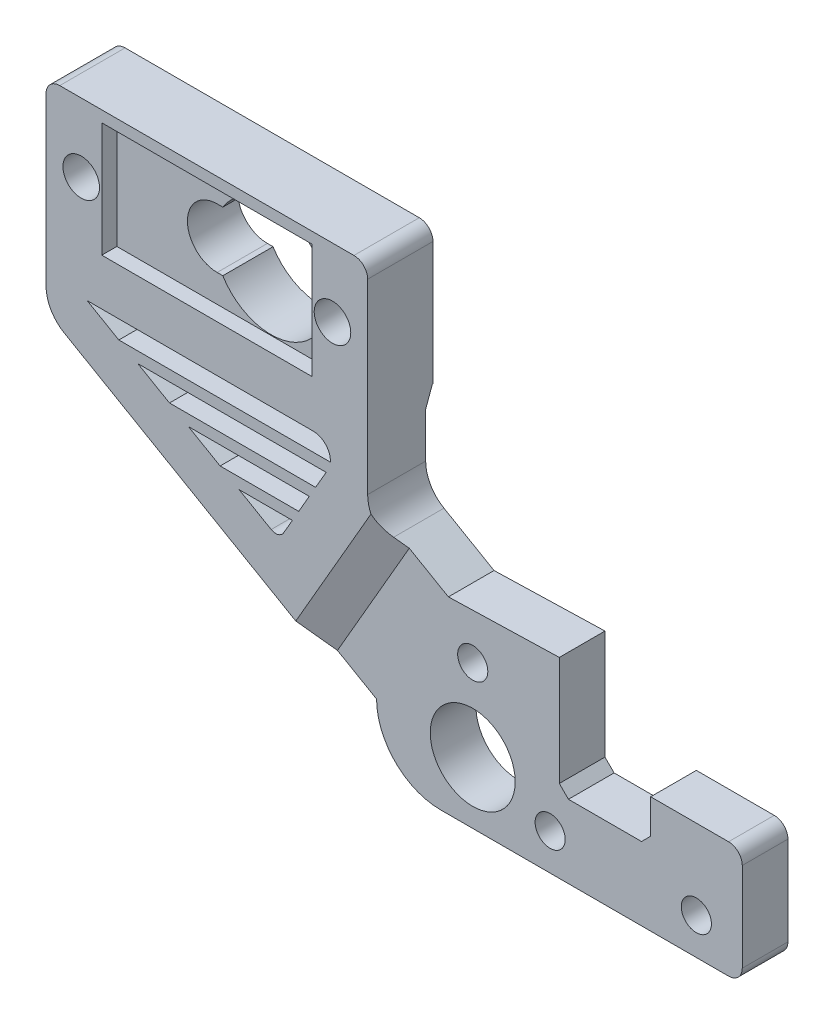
ISO-10303-21;
HEADER;
FILE_DESCRIPTION(('STEP AP214'),'2;1');
FILE_NAME('part.step','',(''),(''),'','','');
FILE_SCHEMA(('AUTOMOTIVE_DESIGN { 1 0 10303 214 1 1 1 1 }'));
ENDSEC;
DATA;
#1=APPLICATION_CONTEXT('core data for automotive mechanical design processes');
#2=APPLICATION_PROTOCOL_DEFINITION('international standard','automotive_design',2000,#1);
#3=PRODUCT_CONTEXT('',#1,'mechanical');
#4=PRODUCT('Part','Part','',(#3));
#5=PRODUCT_RELATED_PRODUCT_CATEGORY('part','',(#4));
#6=PRODUCT_DEFINITION_FORMATION('','',#4);
#7=PRODUCT_DEFINITION_CONTEXT('part definition',#1,'design');
#8=PRODUCT_DEFINITION('design','',#6,#7);
#9=PRODUCT_DEFINITION_SHAPE('','',#8);
#10=(LENGTH_UNIT() NAMED_UNIT(*) SI_UNIT(.MILLI.,.METRE.));
#11=(NAMED_UNIT(*) PLANE_ANGLE_UNIT() SI_UNIT($,.RADIAN.));
#12=(NAMED_UNIT(*) SI_UNIT($,.STERADIAN.) SOLID_ANGLE_UNIT());
#13=UNCERTAINTY_MEASURE_WITH_UNIT(LENGTH_MEASURE(1.E-05),#10,'distance_accuracy_value','');
#14=(GEOMETRIC_REPRESENTATION_CONTEXT(3) GLOBAL_UNCERTAINTY_ASSIGNED_CONTEXT((#13)) GLOBAL_UNIT_ASSIGNED_CONTEXT((#10,
#11,#12)) REPRESENTATION_CONTEXT('',''));
#15=CARTESIAN_POINT('',(0.,0.,0.));
#16=DIRECTION('',(0.,0.,1.));
#17=DIRECTION('',(1.,0.,0.));
#18=AXIS2_PLACEMENT_3D('',#15,#16,#17);
#19=CARTESIAN_POINT('',(-127.345532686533,3.3211524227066,-29.1047126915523));
#20=DIRECTION('',(0.866025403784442,-0.499999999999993,0.));
#21=DIRECTION('',(0.499999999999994,0.866025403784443,0.));
#22=AXIS2_PLACEMENT_3D('',#19,#20,#21);
#23=PLANE('',#22);
#24=DIRECTION('',(-0.499999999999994,-0.866025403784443,0.));
#25=VECTOR('',#24,1.);
#26=CARTESIAN_POINT('',(-127.345532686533,3.3211524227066,0.));
#27=LINE('',#26,#25);
#28=CARTESIAN_POINT('',(-124.539323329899,8.18164960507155,0.));
#29=VERTEX_POINT('',#28);
#30=CARTESIAN_POINT('',(-125.694023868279,6.18164960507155,0.));
#31=VERTEX_POINT('',#30);
#32=EDGE_CURVE('E49',#29,#31,#27,.T.);
#33=ORIENTED_EDGE('',*,*,#32,.T.);
#34=DIRECTION('',(0.,0.,1.));
#35=VECTOR('',#34,1.);
#36=CARTESIAN_POINT('',(-125.694023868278,6.18164960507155,-23.186480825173));
#37=LINE('',#36,#35);
#38=CARTESIAN_POINT('',(-125.694023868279,6.18164960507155,6.35));
#39=VERTEX_POINT('',#38);
#40=EDGE_CURVE('E54',#31,#39,#37,.T.);
#41=ORIENTED_EDGE('',*,*,#40,.T.);
#42=DIRECTION('',(0.499999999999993,0.866025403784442,0.));
#43=VECTOR('',#42,1.);
#44=CARTESIAN_POINT('',(-127.345532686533,3.3211524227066,6.35));
#45=LINE('',#44,#43);
#46=CARTESIAN_POINT('',(-124.539323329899,8.18164960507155,6.35));
#47=VERTEX_POINT('',#46);
#48=EDGE_CURVE('E452',#39,#47,#45,.T.);
#49=ORIENTED_EDGE('',*,*,#48,.T.);
#50=DIRECTION('',(0.,0.,1.));
#51=VECTOR('',#50,1.);
#52=CARTESIAN_POINT('',(-124.539323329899,8.18164960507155,-23.186480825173));
#53=LINE('',#52,#51);
#54=EDGE_CURVE('E401',#29,#47,#53,.T.);
#55=ORIENTED_EDGE('',*,*,#54,.F.);
#56=EDGE_LOOP('',(#33,#41,#49,#55));
#57=FACE_BOUND('',#56,.T.);
#58=ADVANCED_FACE('F34',(#57),#23,.F.);
#59=CARTESIAN_POINT('',(-148.849285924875,14.5816496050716,-29.1047126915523));
#60=DIRECTION('',(-0.499999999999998,-0.86602540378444,0.));
#61=DIRECTION('',(0.86602540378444,-0.499999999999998,0.));
#62=AXIS2_PLACEMENT_3D('',#59,#60,#61);
#63=PLANE('',#62);
#64=DIRECTION('',(0.86602540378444,-0.499999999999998,0.));
#65=VECTOR('',#64,1.);
#66=CARTESIAN_POINT('',(-148.849285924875,14.5816496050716,6.35));
#67=LINE('',#66,#65);
#68=CARTESIAN_POINT('',(-137.764160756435,8.18164960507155,6.35));
#69=VERTEX_POINT('',#68);
#70=CARTESIAN_POINT('',(-134.300059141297,6.1816496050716,6.35));
#71=VERTEX_POINT('',#70);
#72=EDGE_CURVE('E1443',#69,#71,#67,.T.);
#73=ORIENTED_EDGE('',*,*,#72,.T.);
#74=DIRECTION('',(0.,0.,1.));
#75=VECTOR('',#74,1.);
#76=CARTESIAN_POINT('',(-134.300059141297,6.18164960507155,-23.186480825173));
#77=LINE('',#76,#75);
#78=CARTESIAN_POINT('',(-134.300059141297,6.18164960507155,0.));
#79=VERTEX_POINT('',#78);
#80=EDGE_CURVE('E385',#79,#71,#77,.T.);
#81=ORIENTED_EDGE('',*,*,#80,.F.);
#82=DIRECTION('',(-0.86602540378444,0.499999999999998,0.));
#83=VECTOR('',#82,1.);
#84=CARTESIAN_POINT('',(-148.849285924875,14.5816496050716,0.));
#85=LINE('',#84,#83);
#86=CARTESIAN_POINT('',(-137.764160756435,8.18164960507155,0.));
#87=VERTEX_POINT('',#86);
#88=EDGE_CURVE('E432',#79,#87,#85,.T.);
#89=ORIENTED_EDGE('',*,*,#88,.T.);
#90=DIRECTION('',(0.,0.,1.));
#91=VECTOR('',#90,1.);
#92=CARTESIAN_POINT('',(-137.764160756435,8.18164960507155,-23.186480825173));
#93=LINE('',#92,#91);
#94=EDGE_CURVE('E396',#87,#69,#93,.T.);
#95=ORIENTED_EDGE('',*,*,#94,.T.);
#96=EDGE_LOOP('',(#73,#81,#89,#95));
#97=FACE_BOUND('',#96,.T.);
#98=ADVANCED_FACE('F913',(#97),#63,.F.);
#99=CARTESIAN_POINT('',(-122.691802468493,11.3816496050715,0.));
#100=VERTEX_POINT('',#99);
#101=CARTESIAN_POINT('',(-123.846503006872,9.38164960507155,0.));
#102=VERTEX_POINT('',#101);
#103=EDGE_CURVE('E367',#100,#102,#27,.T.);
#104=ORIENTED_EDGE('',*,*,#103,.T.);
#105=DIRECTION('',(0.,0.,1.));
#106=VECTOR('',#105,1.);
#107=CARTESIAN_POINT('',(-123.846503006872,9.38164960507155,-23.186480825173));
#108=LINE('',#107,#106);
#109=CARTESIAN_POINT('',(-123.846503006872,9.38164960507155,6.35));
#110=VERTEX_POINT('',#109);
#111=EDGE_CURVE('E399',#102,#110,#108,.T.);
#112=ORIENTED_EDGE('',*,*,#111,.T.);
#113=CARTESIAN_POINT('',(-122.691802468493,11.3816496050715,6.35));
#114=VERTEX_POINT('',#113);
#115=EDGE_CURVE('E449',#110,#114,#45,.T.);
#116=ORIENTED_EDGE('',*,*,#115,.T.);
#117=DIRECTION('',(0.,0.,-1.));
#118=VECTOR('',#117,1.);
#119=CARTESIAN_POINT('',(-122.691802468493,11.3816496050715,-29.1047126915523));
#120=LINE('',#119,#118);
#121=EDGE_CURVE('E426',#114,#100,#120,.T.);
#122=ORIENTED_EDGE('',*,*,#121,.T.);
#123=EDGE_LOOP('',(#104,#112,#116,#122));
#124=FACE_BOUND('',#123,.T.);
#125=ADVANCED_FACE('F915',(#124),#23,.F.);
#126=CARTESIAN_POINT('',(-143.306723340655,11.3816496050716,6.35));
#127=VERTEX_POINT('',#126);
#128=CARTESIAN_POINT('',(-139.842621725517,9.38164960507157,6.35));
#129=VERTEX_POINT('',#128);
#130=EDGE_CURVE('E446',#127,#129,#67,.T.);
#131=ORIENTED_EDGE('',*,*,#130,.T.);
#132=DIRECTION('',(0.,0.,1.));
#133=VECTOR('',#132,1.);
#134=CARTESIAN_POINT('',(-139.842621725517,9.38164960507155,-23.186480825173));
#135=LINE('',#134,#133);
#136=CARTESIAN_POINT('',(-139.842621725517,9.38164960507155,0.));
#137=VERTEX_POINT('',#136);
#138=EDGE_CURVE('E392',#137,#129,#135,.T.);
#139=ORIENTED_EDGE('',*,*,#138,.F.);
#140=CARTESIAN_POINT('',(-143.306723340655,11.3816496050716,0.));
#141=VERTEX_POINT('',#140);
#142=EDGE_CURVE('E1441',#137,#141,#85,.T.);
#143=ORIENTED_EDGE('',*,*,#142,.T.);
#144=DIRECTION('',(0.,0.,1.));
#145=VECTOR('',#144,1.);
#146=CARTESIAN_POINT('',(-143.306723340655,11.3816496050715,-23.186480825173));
#147=LINE('',#146,#145);
#148=EDGE_CURVE('E418',#141,#127,#147,.T.);
#149=ORIENTED_EDGE('',*,*,#148,.T.);
#150=EDGE_LOOP('',(#131,#139,#143,#149));
#151=FACE_BOUND('',#150,.T.);
#152=ADVANCED_FACE('F922',(#151),#63,.F.);
#153=CARTESIAN_POINT('',(-148.849285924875,14.5816496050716,6.35));
#154=VERTEX_POINT('',#153);
#155=CARTESIAN_POINT('',(-145.385184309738,12.5816496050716,6.35));
#156=VERTEX_POINT('',#155);
#157=EDGE_CURVE('E443',#154,#156,#67,.T.);
#158=ORIENTED_EDGE('',*,*,#157,.T.);
#159=DIRECTION('',(0.,0.,1.));
#160=VECTOR('',#159,1.);
#161=CARTESIAN_POINT('',(-145.385184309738,12.5816496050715,-23.186480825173));
#162=LINE('',#161,#160);
#163=CARTESIAN_POINT('',(-145.385184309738,12.5816496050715,0.));
#164=VERTEX_POINT('',#163);
#165=EDGE_CURVE('E412',#164,#156,#162,.T.);
#166=ORIENTED_EDGE('',*,*,#165,.F.);
#167=CARTESIAN_POINT('',(-148.849285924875,14.5816496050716,0.));
#168=VERTEX_POINT('',#167);
#169=EDGE_CURVE('E433',#164,#168,#85,.T.);
#170=ORIENTED_EDGE('',*,*,#169,.T.);
#171=DIRECTION('',(0.,0.,1.));
#172=VECTOR('',#171,1.);
#173=CARTESIAN_POINT('',(-148.849285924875,14.5816496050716,-29.1047126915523));
#174=LINE('',#173,#172);
#175=EDGE_CURVE('E458',#168,#154,#174,.T.);
#176=ORIENTED_EDGE('',*,*,#175,.T.);
#177=EDGE_LOOP('',(#158,#166,#170,#176));
#178=FACE_BOUND('',#177,.T.);
#179=ADVANCED_FACE('F1013',(#178),#63,.F.);
#180=CARTESIAN_POINT('',(-79.9981081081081,-14.2,5.));
#181=DIRECTION('',(0.,0.,1.));
#182=DIRECTION('',(1.,0.,0.));
#183=AXIS2_PLACEMENT_3D('',#180,#181,#182);
#184=PLANE('',#183);
#185=CARTESIAN_POINT('',(-108.,-8.96025403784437,5.));
#186=DIRECTION('',(0.,0.,1.));
#187=DIRECTION('',(1.,0.,0.));
#188=AXIS2_PLACEMENT_3D('',#185,#186,#187);
#189=CIRCLE('',#188,4.65);
#190=CARTESIAN_POINT('',(-103.35,-8.96025403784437,5.));
#191=VERTEX_POINT('',#190);
#192=EDGE_CURVE('E596',#191,#191,#189,.T.);
#193=ORIENTED_EDGE('',*,*,#192,.F.);
#194=EDGE_LOOP('',(#193));
#195=FACE_BOUND('',#194,.T.);
#196=CARTESIAN_POINT('',(-99.5242859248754,-11.7,5.));
#197=DIRECTION('',(0.,0.,1.));
#198=DIRECTION('',(1.,0.,0.));
#199=AXIS2_PLACEMENT_3D('',#196,#197,#198);
#200=CIRCLE('',#199,1.65);
#201=CARTESIAN_POINT('',(-97.8742859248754,-11.7,5.));
#202=VERTEX_POINT('',#201);
#203=EDGE_CURVE('E608',#202,#202,#200,.T.);
#204=ORIENTED_EDGE('',*,*,#203,.F.);
#205=EDGE_LOOP('',(#204));
#206=FACE_BOUND('',#205,.T.);
#207=CARTESIAN_POINT('',(-108.,0.,5.));
#208=DIRECTION('',(0.,0.,1.));
#209=DIRECTION('',(1.,0.,0.));
#210=AXIS2_PLACEMENT_3D('',#207,#208,#209);
#211=CIRCLE('',#210,1.65);
#212=CARTESIAN_POINT('',(-106.35,0.,5.));
#213=VERTEX_POINT('',#212);
#214=EDGE_CURVE('E602',#213,#213,#211,.T.);
#215=ORIENTED_EDGE('',*,*,#214,.F.);
#216=EDGE_LOOP('',(#215));
#217=FACE_BOUND('',#216,.T.);
#218=CARTESIAN_POINT('',(-83.5242859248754,-11.7,5.));
#219=DIRECTION('',(0.,0.,1.));
#220=DIRECTION('',(1.,0.,0.));
#221=AXIS2_PLACEMENT_3D('',#218,#219,#220);
#222=CIRCLE('',#221,1.65);
#223=CARTESIAN_POINT('',(-81.8742859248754,-11.7,5.));
#224=VERTEX_POINT('',#223);
#225=EDGE_CURVE('E590',#224,#224,#222,.T.);
#226=ORIENTED_EDGE('',*,*,#225,.F.);
#227=EDGE_LOOP('',(#226));
#228=FACE_BOUND('',#227,.T.);
#229=DIRECTION('',(-0.999623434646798,-0.02744064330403,0.));
#230=VECTOR('',#229,1.);
#231=CARTESIAN_POINT('',(-98.5242859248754,5.24835293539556,5.));
#232=LINE('',#231,#230);
#233=CARTESIAN_POINT('',(-98.5242859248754,5.24835293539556,5.));
#234=VERTEX_POINT('',#233);
#235=CARTESIAN_POINT('',(-110.663594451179,4.91511701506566,5.00000000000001));
#236=VERTEX_POINT('',#235);
#237=EDGE_CURVE('E635',#234,#236,#232,.T.);
#238=ORIENTED_EDGE('',*,*,#237,.T.);
#239=DIRECTION('',(0.86602540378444,-0.499999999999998,0.));
#240=VECTOR('',#239,1.);
#241=CARTESIAN_POINT('',(-79.3873912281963,-13.1422073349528,5.));
#242=LINE('',#241,#240);
#243=CARTESIAN_POINT('',(-114.942544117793,7.38556975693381,5.));
#244=VERTEX_POINT('',#243);
#245=EDGE_CURVE('E720',#244,#236,#242,.T.);
#246=ORIENTED_EDGE('',*,*,#245,.F.);
#247=DIRECTION('',(0.499999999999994,0.866025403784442,0.));
#248=VECTOR('',#247,1.);
#249=CARTESIAN_POINT('',(-122.803235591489,-6.22954725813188,5.));
#250=LINE('',#249,#248);
#251=CARTESIAN_POINT('',(-122.803235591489,-6.22954725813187,5.));
#252=VERTEX_POINT('',#251);
#253=EDGE_CURVE('E722',#244,#252,#250,.F.);
#254=ORIENTED_EDGE('',*,*,#253,.T.);
#255=DIRECTION('',(-0.86602540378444,0.499999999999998,0.));
#256=VECTOR('',#255,1.);
#257=CARTESIAN_POINT('',(-87.2480827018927,-26.7573243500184,5.));
#258=LINE('',#257,#256);
#259=CARTESIAN_POINT('',(-118.524285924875,-8.70000000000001,5.00000000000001));
#260=VERTEX_POINT('',#259);
#261=EDGE_CURVE('E713',#260,#252,#258,.T.);
#262=ORIENTED_EDGE('',*,*,#261,.F.);
#263=CARTESIAN_POINT('',(-111.524285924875,-8.70000000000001,5.));
#264=DIRECTION('',(0.,0.,1.));
#265=DIRECTION('',(1.,0.,0.));
#266=AXIS2_PLACEMENT_3D('',#263,#264,#265);
#267=CIRCLE('',#266,7.);
#268=CARTESIAN_POINT('',(-111.524285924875,-15.7,5.));
#269=VERTEX_POINT('',#268);
#270=EDGE_CURVE('E638',#260,#269,#267,.T.);
#271=ORIENTED_EDGE('',*,*,#270,.T.);
#272=DIRECTION('',(1.,0.,0.));
#273=VECTOR('',#272,1.);
#274=CARTESIAN_POINT('',(-111.524285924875,-15.7,5.));
#275=LINE('',#274,#273);
#276=CARTESIAN_POINT('',(-79.9981081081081,-15.7,5.));
#277=VERTEX_POINT('',#276);
#278=EDGE_CURVE('E614',#269,#277,#275,.T.);
#279=ORIENTED_EDGE('',*,*,#278,.T.);
#280=CARTESIAN_POINT('',(-79.9981081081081,-14.2,5.));
#281=DIRECTION('',(0.,0.,1.));
#282=DIRECTION('',(1.,0.,0.));
#283=AXIS2_PLACEMENT_3D('',#280,#281,#282);
#284=CIRCLE('',#283,1.5);
#285=CARTESIAN_POINT('',(-78.4981081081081,-14.2,5.));
#286=VERTEX_POINT('',#285);
#287=EDGE_CURVE('E616',#277,#286,#284,.T.);
#288=ORIENTED_EDGE('',*,*,#287,.T.);
#289=DIRECTION('',(0.,1.,0.));
#290=VECTOR('',#289,1.);
#291=CARTESIAN_POINT('',(-78.4981081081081,-14.2,5.));
#292=LINE('',#291,#290);
#293=CARTESIAN_POINT('',(-78.4981081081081,-4.4602540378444,5.));
#294=VERTEX_POINT('',#293);
#295=EDGE_CURVE('E619',#286,#294,#292,.T.);
#296=ORIENTED_EDGE('',*,*,#295,.T.);
#297=CARTESIAN_POINT('',(-79.9981081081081,-4.46025403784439,5.));
#298=DIRECTION('',(0.,0.,1.));
#299=DIRECTION('',(1.,0.,0.));
#300=AXIS2_PLACEMENT_3D('',#297,#298,#299);
#301=CIRCLE('',#300,1.5);
#302=CARTESIAN_POINT('',(-79.9981081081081,-2.96025403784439,5.));
#303=VERTEX_POINT('',#302);
#304=EDGE_CURVE('E621',#294,#303,#301,.T.);
#305=ORIENTED_EDGE('',*,*,#304,.T.);
#306=DIRECTION('',(-1.,0.,0.));
#307=VECTOR('',#306,1.);
#308=CARTESIAN_POINT('',(-79.9981081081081,-2.96025403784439,5.));
#309=LINE('',#308,#307);
#310=CARTESIAN_POINT('',(-88.5242859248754,-2.96025403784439,5.));
#311=VERTEX_POINT('',#310);
#312=EDGE_CURVE('E623',#303,#311,#309,.T.);
#313=ORIENTED_EDGE('',*,*,#312,.T.);
#314=DIRECTION('',(0.,-1.,0.));
#315=VECTOR('',#314,1.);
#316=CARTESIAN_POINT('',(-88.5242859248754,-2.96025403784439,5.));
#317=LINE('',#316,#315);
#318=CARTESIAN_POINT('',(-88.5242859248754,-6.70000000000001,5.));
#319=VERTEX_POINT('',#318);
#320=EDGE_CURVE('E625',#311,#319,#317,.T.);
#321=ORIENTED_EDGE('',*,*,#320,.T.);
#322=DIRECTION('',(-0.707106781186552,-0.707106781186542,0.));
#323=VECTOR('',#322,1.);
#324=CARTESIAN_POINT('',(-88.5242859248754,-6.70000000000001,5.));
#325=LINE('',#324,#323);
#326=CARTESIAN_POINT('',(-89.5242859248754,-7.70000000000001,5.));
#327=VERTEX_POINT('',#326);
#328=EDGE_CURVE('E627',#319,#327,#325,.T.);
#329=ORIENTED_EDGE('',*,*,#328,.T.);
#330=DIRECTION('',(-1.,0.,0.));
#331=VECTOR('',#330,1.);
#332=CARTESIAN_POINT('',(-89.5242859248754,-7.70000000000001,5.));
#333=LINE('',#332,#331);
#334=CARTESIAN_POINT('',(-97.5242859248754,-7.70000000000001,5.));
#335=VERTEX_POINT('',#334);
#336=EDGE_CURVE('E629',#327,#335,#333,.T.);
#337=ORIENTED_EDGE('',*,*,#336,.T.);
#338=DIRECTION('',(-0.707106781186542,0.707106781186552,0.));
#339=VECTOR('',#338,1.);
#340=CARTESIAN_POINT('',(-97.5242859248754,-7.70000000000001,5.));
#341=LINE('',#340,#339);
#342=CARTESIAN_POINT('',(-98.5242859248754,-6.7,5.));
#343=VERTEX_POINT('',#342);
#344=EDGE_CURVE('E631',#335,#343,#341,.T.);
#345=ORIENTED_EDGE('',*,*,#344,.T.);
#346=DIRECTION('',(0.,1.,0.));
#347=VECTOR('',#346,1.);
#348=CARTESIAN_POINT('',(-98.5242859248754,-6.7,5.));
#349=LINE('',#348,#347);
#350=EDGE_CURVE('E633',#343,#234,#349,.T.);
#351=ORIENTED_EDGE('',*,*,#350,.T.);
#352=EDGE_LOOP('',(#238,#246,#254,#262,#271,#279,#288,#296,#305,#313,#321,#329,#337,#345,#351));
#353=FACE_BOUND('',#352,.T.);
#354=ADVANCED_FACE('F820',(#195,#206,#217,#228,#353),#184,.T.);
#355=CARTESIAN_POINT('',(-98.5242859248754,5.24835293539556,5.));
#356=DIRECTION('',(0.02744064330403,-0.999623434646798,0.));
#357=DIRECTION('',(0.999623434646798,0.02744064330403,0.));
#358=AXIS2_PLACEMENT_3D('',#355,#356,#357);
#359=PLANE('',#358);
#360=DIRECTION('',(0.,0.,-1.));
#361=VECTOR('',#360,1.);
#362=CARTESIAN_POINT('',(-110.663594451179,4.91511701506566,56.9454691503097));
#363=LINE('',#362,#361);
#364=CARTESIAN_POINT('',(-110.663594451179,4.91511701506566,0.));
#365=VERTEX_POINT('',#364);
#366=EDGE_CURVE('E579',#236,#365,#363,.T.);
#367=ORIENTED_EDGE('',*,*,#366,.F.);
#368=ORIENTED_EDGE('',*,*,#237,.F.);
#369=DIRECTION('',(0.,0.,-1.));
#370=VECTOR('',#369,1.);
#371=CARTESIAN_POINT('',(-98.5242859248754,5.24835293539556,5.));
#372=LINE('',#371,#370);
#373=CARTESIAN_POINT('',(-98.5242859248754,5.24835293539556,0.));
#374=VERTEX_POINT('',#373);
#375=EDGE_CURVE('E671',#234,#374,#372,.T.);
#376=ORIENTED_EDGE('',*,*,#375,.T.);
#377=DIRECTION('',(-0.999623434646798,-0.02744064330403,0.));
#378=VECTOR('',#377,1.);
#379=CARTESIAN_POINT('',(-98.5242859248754,5.24835293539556,0.));
#380=LINE('',#379,#378);
#381=EDGE_CURVE('E661',#374,#365,#380,.T.);
#382=ORIENTED_EDGE('',*,*,#381,.T.);
#383=EDGE_LOOP('',(#367,#368,#376,#382));
#384=FACE_BOUND('',#383,.T.);
#385=ADVANCED_FACE('F829',(#384),#359,.F.);
#386=CARTESIAN_POINT('',(-79.9981081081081,-14.2,0.));
#387=DIRECTION('',(0.,0.,1.));
#388=DIRECTION('',(1.,0.,0.));
#389=AXIS2_PLACEMENT_3D('',#386,#387,#388);
#390=PLANE('',#389);
#391=CARTESIAN_POINT('',(-126.386844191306,4.98164960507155,0.));
#392=VERTEX_POINT('',#391);
#393=CARTESIAN_POINT('',(-127.345532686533,3.3211524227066,0.));
#394=VERTEX_POINT('',#393);
#395=EDGE_CURVE('E355',#392,#394,#27,.T.);
#396=ORIENTED_EDGE('',*,*,#395,.F.);
#397=DIRECTION('',(-1.,0.,0.));
#398=VECTOR('',#397,1.);
#399=CARTESIAN_POINT('',(-132.221598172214,4.98164960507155,0.));
#400=LINE('',#399,#398);
#401=CARTESIAN_POINT('',(-132.221598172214,4.98164960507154,0.));
#402=VERTEX_POINT('',#401);
#403=EDGE_CURVE('E361',#392,#402,#400,.T.);
#404=ORIENTED_EDGE('',*,*,#403,.T.);
#405=CARTESIAN_POINT('',(-128.711558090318,2.95512701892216,0.));
#406=VERTEX_POINT('',#405);
#407=EDGE_CURVE('E430',#406,#402,#85,.T.);
#408=ORIENTED_EDGE('',*,*,#407,.F.);
#409=CARTESIAN_POINT('',(-128.211558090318,3.8211524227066,0.));
#410=DIRECTION('',(0.,0.,1.));
#411=DIRECTION('',(1.,0.,0.));
#412=AXIS2_PLACEMENT_3D('',#409,#410,#411);
#413=CIRCLE('',#412,0.999999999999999);
#414=EDGE_CURVE('E363',#394,#406,#413,.F.);
#415=ORIENTED_EDGE('',*,*,#414,.F.);
#416=EDGE_LOOP('',(#396,#404,#408,#415));
#417=FACE_BOUND('',#416,.T.);
#418=ORIENTED_EDGE('',*,*,#32,.F.);
#419=DIRECTION('',(-1.,0.,0.));
#420=VECTOR('',#419,1.);
#421=CARTESIAN_POINT('',(-137.764160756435,8.18164960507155,0.));
#422=LINE('',#421,#420);
#423=EDGE_CURVE('E391',#29,#87,#422,.T.);
#424=ORIENTED_EDGE('',*,*,#423,.T.);
#425=ORIENTED_EDGE('',*,*,#88,.F.);
#426=DIRECTION('',(1.,0.,0.));
#427=VECTOR('',#426,1.);
#428=CARTESIAN_POINT('',(-134.300059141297,6.18164960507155,0.));
#429=LINE('',#428,#427);
#430=EDGE_CURVE('E380',#79,#31,#429,.T.);
#431=ORIENTED_EDGE('',*,*,#430,.T.);
#432=EDGE_LOOP('',(#418,#424,#425,#431));
#433=FACE_BOUND('',#432,.T.);
#434=DIRECTION('',(1.,0.,0.));
#435=VECTOR('',#434,1.);
#436=CARTESIAN_POINT('',(-145.385184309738,12.5816496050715,0.));
#437=LINE('',#436,#435);
#438=CARTESIAN_POINT('',(-122.229776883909,12.5816496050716,0.));
#439=VERTEX_POINT('',#438);
#440=EDGE_CURVE('E408',#164,#439,#437,.T.);
#441=ORIENTED_EDGE('',*,*,#440,.T.);
#442=CARTESIAN_POINT('',(-124.11454428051,12.6935625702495,0.));
#443=DIRECTION('',(0.,0.,1.));
#444=DIRECTION('',(1.,0.,0.));
#445=AXIS2_PLACEMENT_3D('',#442,#443,#444);
#446=CIRCLE('',#445,1.88808703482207);
#447=CARTESIAN_POINT('',(-124.11454428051,14.5816496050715,0.));
#448=VERTEX_POINT('',#447);
#449=EDGE_CURVE('E435',#448,#439,#446,.F.);
#450=ORIENTED_EDGE('',*,*,#449,.F.);
#451=DIRECTION('',(1.,0.,0.));
#452=VECTOR('',#451,1.);
#453=CARTESIAN_POINT('',(-148.849285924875,14.5816496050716,0.));
#454=LINE('',#453,#452);
#455=EDGE_CURVE('E437',#168,#448,#454,.T.);
#456=ORIENTED_EDGE('',*,*,#455,.F.);
#457=ORIENTED_EDGE('',*,*,#169,.F.);
#458=EDGE_LOOP('',(#441,#450,#456,#457));
#459=FACE_BOUND('',#458,.T.);
#460=ORIENTED_EDGE('',*,*,#103,.F.);
#461=DIRECTION('',(-1.,0.,0.));
#462=VECTOR('',#461,1.);
#463=CARTESIAN_POINT('',(-122.229776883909,11.3816496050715,0.));
#464=LINE('',#463,#462);
#465=EDGE_CURVE('E411',#100,#141,#464,.T.);
#466=ORIENTED_EDGE('',*,*,#465,.T.);
#467=ORIENTED_EDGE('',*,*,#142,.F.);
#468=DIRECTION('',(1.,0.,0.));
#469=VECTOR('',#468,1.);
#470=CARTESIAN_POINT('',(-139.842621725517,9.38164960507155,0.));
#471=LINE('',#470,#469);
#472=EDGE_CURVE('E389',#137,#102,#471,.T.);
#473=ORIENTED_EDGE('',*,*,#472,.T.);
#474=EDGE_LOOP('',(#460,#466,#467,#473));
#475=FACE_BOUND('',#474,.T.);
#476=DIRECTION('',(0.86602540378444,-0.499999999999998,0.));
#477=VECTOR('',#476,1.);
#478=CARTESIAN_POINT('',(-118.524285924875,-8.70000000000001,0.));
#479=LINE('',#478,#477);
#480=CARTESIAN_POINT('',(-151.349285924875,10.2515225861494,0.));
#481=VERTEX_POINT('',#480);
#482=CARTESIAN_POINT('',(-118.524285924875,-8.70000000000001,0.));
#483=VERTEX_POINT('',#482);
#484=EDGE_CURVE('E569',#481,#483,#479,.T.);
#485=ORIENTED_EDGE('',*,*,#484,.F.);
#486=CARTESIAN_POINT('',(-149.349285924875,13.7156242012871,0.));
#487=DIRECTION('',(0.,0.,1.));
#488=DIRECTION('',(1.,0.,0.));
#489=AXIS2_PLACEMENT_3D('',#486,#487,#488);
#490=CIRCLE('',#489,4.);
#491=CARTESIAN_POINT('',(-153.349285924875,13.7156242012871,0.));
#492=VERTEX_POINT('',#491);
#493=EDGE_CURVE('E746',#481,#492,#490,.F.);
#494=ORIENTED_EDGE('',*,*,#493,.T.);
#495=DIRECTION('',(0.,-1.,0.));
#496=VECTOR('',#495,1.);
#497=CARTESIAN_POINT('',(-153.349285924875,11.4062231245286,0.));
#498=LINE('',#497,#496);
#499=CARTESIAN_POINT('',(-153.349285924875,16.4630860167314,0.));
#500=VERTEX_POINT('',#499);
#501=EDGE_CURVE('E576',#500,#492,#498,.T.);
#502=ORIENTED_EDGE('',*,*,#501,.F.);
#503=DIRECTION('',(1.,0.,0.));
#504=VECTOR('',#503,1.);
#505=CARTESIAN_POINT('',(-118.149285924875,16.4630860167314,0.));
#506=LINE('',#505,#504);
#507=CARTESIAN_POINT('',(-118.149285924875,16.4630860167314,0.));
#508=VERTEX_POINT('',#507);
#509=EDGE_CURVE('E704',#500,#508,#506,.T.);
#510=ORIENTED_EDGE('',*,*,#509,.T.);
#511=DIRECTION('',(0.,1.,0.));
#512=VECTOR('',#511,1.);
#513=CARTESIAN_POINT('',(-118.149285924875,9.23698300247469,0.));
#514=LINE('',#513,#512);
#515=CARTESIAN_POINT('',(-118.149285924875,11.5463840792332,0.));
#516=VERTEX_POINT('',#515);
#517=EDGE_CURVE('E574',#516,#508,#514,.T.);
#518=ORIENTED_EDGE('',*,*,#517,.F.);
#519=CARTESIAN_POINT('',(-114.149285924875,11.5463840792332,0.));
#520=DIRECTION('',(0.,0.,1.));
#521=DIRECTION('',(1.,0.,0.));
#522=AXIS2_PLACEMENT_3D('',#519,#520,#521);
#523=CIRCLE('',#522,4.);
#524=CARTESIAN_POINT('',(-116.149285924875,8.08228246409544,0.));
#525=VERTEX_POINT('',#524);
#526=EDGE_CURVE('E757',#516,#525,#523,.T.);
#527=ORIENTED_EDGE('',*,*,#526,.T.);
#528=DIRECTION('',(-0.86602540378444,0.499999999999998,0.));
#529=VECTOR('',#528,1.);
#530=CARTESIAN_POINT('',(-110.663594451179,4.91511701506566,0.));
#531=LINE('',#530,#529);
#532=EDGE_CURVE('E571',#365,#525,#531,.T.);
#533=ORIENTED_EDGE('',*,*,#532,.F.);
#534=ORIENTED_EDGE('',*,*,#381,.F.);
#535=DIRECTION('',(0.,1.,0.));
#536=VECTOR('',#535,1.);
#537=CARTESIAN_POINT('',(-98.5242859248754,-6.7,0.));
#538=LINE('',#537,#536);
#539=CARTESIAN_POINT('',(-98.5242859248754,-6.7,0.));
#540=VERTEX_POINT('',#539);
#541=EDGE_CURVE('E659',#540,#374,#538,.T.);
#542=ORIENTED_EDGE('',*,*,#541,.F.);
#543=DIRECTION('',(-0.707106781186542,0.707106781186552,0.));
#544=VECTOR('',#543,1.);
#545=CARTESIAN_POINT('',(-97.5242859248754,-7.70000000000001,0.));
#546=LINE('',#545,#544);
#547=CARTESIAN_POINT('',(-97.5242859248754,-7.70000000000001,0.));
#548=VERTEX_POINT('',#547);
#549=EDGE_CURVE('E657',#548,#540,#546,.T.);
#550=ORIENTED_EDGE('',*,*,#549,.F.);
#551=DIRECTION('',(-1.,0.,0.));
#552=VECTOR('',#551,1.);
#553=CARTESIAN_POINT('',(-89.5242859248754,-7.70000000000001,0.));
#554=LINE('',#553,#552);
#555=CARTESIAN_POINT('',(-89.5242859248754,-7.70000000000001,0.));
#556=VERTEX_POINT('',#555);
#557=EDGE_CURVE('E655',#556,#548,#554,.T.);
#558=ORIENTED_EDGE('',*,*,#557,.F.);
#559=DIRECTION('',(-0.707106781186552,-0.707106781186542,0.));
#560=VECTOR('',#559,1.);
#561=CARTESIAN_POINT('',(-88.5242859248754,-6.70000000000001,0.));
#562=LINE('',#561,#560);
#563=CARTESIAN_POINT('',(-88.5242859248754,-6.70000000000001,0.));
#564=VERTEX_POINT('',#563);
#565=EDGE_CURVE('E653',#564,#556,#562,.T.);
#566=ORIENTED_EDGE('',*,*,#565,.F.);
#567=DIRECTION('',(0.,-1.,0.));
#568=VECTOR('',#567,1.);
#569=CARTESIAN_POINT('',(-88.5242859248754,-2.96025403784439,0.));
#570=LINE('',#569,#568);
#571=CARTESIAN_POINT('',(-88.5242859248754,-2.96025403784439,0.));
#572=VERTEX_POINT('',#571);
#573=EDGE_CURVE('E651',#572,#564,#570,.T.);
#574=ORIENTED_EDGE('',*,*,#573,.F.);
#575=DIRECTION('',(-1.,0.,0.));
#576=VECTOR('',#575,1.);
#577=CARTESIAN_POINT('',(-80.4981081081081,-2.96025403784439,0.));
#578=LINE('',#577,#576);
#579=CARTESIAN_POINT('',(-79.9981081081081,-2.96025403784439,0.));
#580=VERTEX_POINT('',#579);
#581=EDGE_CURVE('E649',#580,#572,#578,.T.);
#582=ORIENTED_EDGE('',*,*,#581,.F.);
#583=CARTESIAN_POINT('',(-79.9981081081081,-4.46025403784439,0.));
#584=DIRECTION('',(0.,0.,1.));
#585=DIRECTION('',(1.,0.,0.));
#586=AXIS2_PLACEMENT_3D('',#583,#584,#585);
#587=CIRCLE('',#586,1.5);
#588=CARTESIAN_POINT('',(-78.4981081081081,-4.4602540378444,0.));
#589=VERTEX_POINT('',#588);
#590=EDGE_CURVE('E646',#589,#580,#587,.T.);
#591=ORIENTED_EDGE('',*,*,#590,.F.);
#592=DIRECTION('',(0.,1.,0.));
#593=VECTOR('',#592,1.);
#594=CARTESIAN_POINT('',(-78.4981081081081,-14.2,0.));
#595=LINE('',#594,#593);
#596=CARTESIAN_POINT('',(-78.4981081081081,-14.2,0.));
#597=VERTEX_POINT('',#596);
#598=EDGE_CURVE('E644',#597,#589,#595,.T.);
#599=ORIENTED_EDGE('',*,*,#598,.F.);
#600=CARTESIAN_POINT('',(-79.9981081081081,-14.2,0.));
#601=DIRECTION('',(0.,0.,1.));
#602=DIRECTION('',(1.,0.,0.));
#603=AXIS2_PLACEMENT_3D('',#600,#601,#602);
#604=CIRCLE('',#603,1.5);
#605=CARTESIAN_POINT('',(-79.9981081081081,-15.7,0.));
#606=VERTEX_POINT('',#605);
#607=EDGE_CURVE('E642',#606,#597,#604,.T.);
#608=ORIENTED_EDGE('',*,*,#607,.F.);
#609=DIRECTION('',(1.,0.,0.));
#610=VECTOR('',#609,1.);
#611=CARTESIAN_POINT('',(-80.4981081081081,-15.7,0.));
#612=LINE('',#611,#610);
#613=CARTESIAN_POINT('',(-111.524285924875,-15.7,0.));
#614=VERTEX_POINT('',#613);
#615=EDGE_CURVE('E611',#614,#606,#612,.T.);
#616=ORIENTED_EDGE('',*,*,#615,.F.);
#617=CARTESIAN_POINT('',(-111.524285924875,-8.70000000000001,0.));
#618=DIRECTION('',(0.,0.,1.));
#619=DIRECTION('',(1.,0.,0.));
#620=AXIS2_PLACEMENT_3D('',#617,#618,#619);
#621=CIRCLE('',#620,7.);
#622=EDGE_CURVE('E617',#483,#614,#621,.T.);
#623=ORIENTED_EDGE('',*,*,#622,.F.);
#624=EDGE_LOOP('',(#485,#494,#502,#510,#518,#527,#533,#534,#542,#550,#558,#566,#574,#582,#591,
#599,#608,#616,#623));
#625=FACE_BOUND('',#624,.T.);
#626=CARTESIAN_POINT('',(-83.5242859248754,-11.7,0.));
#627=DIRECTION('',(0.,0.,1.));
#628=DIRECTION('',(1.,0.,0.));
#629=AXIS2_PLACEMENT_3D('',#626,#627,#628);
#630=CIRCLE('',#629,1.65);
#631=CARTESIAN_POINT('',(-81.8742859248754,-11.7,0.));
#632=VERTEX_POINT('',#631);
#633=EDGE_CURVE('E587',#632,#632,#630,.T.);
#634=ORIENTED_EDGE('',*,*,#633,.T.);
#635=EDGE_LOOP('',(#634));
#636=FACE_BOUND('',#635,.T.);
#637=CARTESIAN_POINT('',(-108.,-8.96025403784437,0.));
#638=DIRECTION('',(0.,0.,1.));
#639=DIRECTION('',(1.,0.,0.));
#640=AXIS2_PLACEMENT_3D('',#637,#638,#639);
#641=CIRCLE('',#640,4.65);
#642=CARTESIAN_POINT('',(-103.35,-8.96025403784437,0.));
#643=VERTEX_POINT('',#642);
#644=EDGE_CURVE('E593',#643,#643,#641,.T.);
#645=ORIENTED_EDGE('',*,*,#644,.T.);
#646=EDGE_LOOP('',(#645));
#647=FACE_BOUND('',#646,.T.);
#648=CARTESIAN_POINT('',(-108.,0.,0.));
#649=DIRECTION('',(0.,0.,1.));
#650=DIRECTION('',(1.,0.,0.));
#651=AXIS2_PLACEMENT_3D('',#648,#649,#650);
#652=CIRCLE('',#651,1.65);
#653=CARTESIAN_POINT('',(-106.35,0.,0.));
#654=VERTEX_POINT('',#653);
#655=EDGE_CURVE('E599',#654,#654,#652,.T.);
#656=ORIENTED_EDGE('',*,*,#655,.T.);
#657=EDGE_LOOP('',(#656));
#658=FACE_BOUND('',#657,.T.);
#659=CARTESIAN_POINT('',(-99.5242859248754,-11.7,0.));
#660=DIRECTION('',(0.,0.,1.));
#661=DIRECTION('',(1.,0.,0.));
#662=AXIS2_PLACEMENT_3D('',#659,#660,#661);
#663=CIRCLE('',#662,1.65);
#664=CARTESIAN_POINT('',(-97.8742859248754,-11.7,0.));
#665=VERTEX_POINT('',#664);
#666=EDGE_CURVE('E605',#665,#665,#663,.T.);
#667=ORIENTED_EDGE('',*,*,#666,.T.);
#668=EDGE_LOOP('',(#667));
#669=FACE_BOUND('',#668,.T.);
#670=ADVANCED_FACE('F357',(#417,#433,#459,#475,#625,#636,#647,#658,#669),#390,.F.);
#671=CARTESIAN_POINT('',(-80.4981081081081,-15.7,5.));
#672=DIRECTION('',(0.,1.,0.));
#673=DIRECTION('',(0.,0.,1.));
#674=AXIS2_PLACEMENT_3D('',#671,#672,#673);
#675=PLANE('',#674);
#676=ORIENTED_EDGE('',*,*,#615,.T.);
#677=DIRECTION('',(0.,0.,-1.));
#678=VECTOR('',#677,1.);
#679=CARTESIAN_POINT('',(-79.9981081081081,-15.7,5.));
#680=LINE('',#679,#678);
#681=EDGE_CURVE('E698',#277,#606,#680,.T.);
#682=ORIENTED_EDGE('',*,*,#681,.F.);
#683=ORIENTED_EDGE('',*,*,#278,.F.);
#684=DIRECTION('',(0.,0.,-1.));
#685=VECTOR('',#684,1.);
#686=CARTESIAN_POINT('',(-111.524285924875,-15.7,5.));
#687=LINE('',#686,#685);
#688=EDGE_CURVE('E640',#269,#614,#687,.T.);
#689=ORIENTED_EDGE('',*,*,#688,.T.);
#690=EDGE_LOOP('',(#676,#682,#683,#689));
#691=FACE_BOUND('',#690,.T.);
#692=ADVANCED_FACE('F816',(#691),#675,.F.);
#693=CARTESIAN_POINT('',(-79.9981081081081,-14.2,5.));
#694=DIRECTION('',(0.,0.,-1.));
#695=DIRECTION('',(-1.,0.,0.));
#696=AXIS2_PLACEMENT_3D('',#693,#694,#695);
#697=CYLINDRICAL_SURFACE('',#696,1.5);
#698=ORIENTED_EDGE('',*,*,#607,.T.);
#699=DIRECTION('',(0.,0.,-1.));
#700=VECTOR('',#699,1.);
#701=CARTESIAN_POINT('',(-78.4981081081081,-14.2,5.));
#702=LINE('',#701,#700);
#703=EDGE_CURVE('E695',#286,#597,#702,.T.);
#704=ORIENTED_EDGE('',*,*,#703,.F.);
#705=ORIENTED_EDGE('',*,*,#287,.F.);
#706=ORIENTED_EDGE('',*,*,#681,.T.);
#707=EDGE_LOOP('',(#698,#704,#705,#706));
#708=FACE_BOUND('',#707,.T.);
#709=ADVANCED_FACE('F1052',(#708),#697,.T.);
#710=CARTESIAN_POINT('',(-78.4981081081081,-14.2,5.));
#711=DIRECTION('',(-1.,0.,0.));
#712=DIRECTION('',(0.,0.,1.));
#713=AXIS2_PLACEMENT_3D('',#710,#711,#712);
#714=PLANE('',#713);
#715=ORIENTED_EDGE('',*,*,#598,.T.);
#716=DIRECTION('',(0.,0.,-1.));
#717=VECTOR('',#716,1.);
#718=CARTESIAN_POINT('',(-78.4981081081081,-4.4602540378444,5.));
#719=LINE('',#718,#717);
#720=EDGE_CURVE('E692',#294,#589,#719,.T.);
#721=ORIENTED_EDGE('',*,*,#720,.F.);
#722=ORIENTED_EDGE('',*,*,#295,.F.);
#723=ORIENTED_EDGE('',*,*,#703,.T.);
#724=EDGE_LOOP('',(#715,#721,#722,#723));
#725=FACE_BOUND('',#724,.T.);
#726=ADVANCED_FACE('F1048',(#725),#714,.F.);
#727=CARTESIAN_POINT('',(-79.9981081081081,-4.46025403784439,5.));
#728=DIRECTION('',(0.,0.,-1.));
#729=DIRECTION('',(-1.,0.,0.));
#730=AXIS2_PLACEMENT_3D('',#727,#728,#729);
#731=CYLINDRICAL_SURFACE('',#730,1.5);
#732=ORIENTED_EDGE('',*,*,#590,.T.);
#733=DIRECTION('',(0.,0.,-1.));
#734=VECTOR('',#733,1.);
#735=CARTESIAN_POINT('',(-79.9981081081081,-2.96025403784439,5.));
#736=LINE('',#735,#734);
#737=EDGE_CURVE('E689',#303,#580,#736,.T.);
#738=ORIENTED_EDGE('',*,*,#737,.F.);
#739=ORIENTED_EDGE('',*,*,#304,.F.);
#740=ORIENTED_EDGE('',*,*,#720,.T.);
#741=EDGE_LOOP('',(#732,#738,#739,#740));
#742=FACE_BOUND('',#741,.T.);
#743=ADVANCED_FACE('F1044',(#742),#731,.T.);
#744=CARTESIAN_POINT('',(-80.4981081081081,-2.96025403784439,5.));
#745=DIRECTION('',(0.,-1.,0.));
#746=DIRECTION('',(0.,0.,-1.));
#747=AXIS2_PLACEMENT_3D('',#744,#745,#746);
#748=PLANE('',#747);
#749=ORIENTED_EDGE('',*,*,#581,.T.);
#750=DIRECTION('',(0.,0.,-1.));
#751=VECTOR('',#750,1.);
#752=CARTESIAN_POINT('',(-88.5242859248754,-2.96025403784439,5.));
#753=LINE('',#752,#751);
#754=EDGE_CURVE('E686',#311,#572,#753,.T.);
#755=ORIENTED_EDGE('',*,*,#754,.F.);
#756=ORIENTED_EDGE('',*,*,#312,.F.);
#757=ORIENTED_EDGE('',*,*,#737,.T.);
#758=EDGE_LOOP('',(#749,#755,#756,#757));
#759=FACE_BOUND('',#758,.T.);
#760=ADVANCED_FACE('F1040',(#759),#748,.F.);
#761=CARTESIAN_POINT('',(-88.5242859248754,-2.96025403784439,5.));
#762=DIRECTION('',(1.,0.,0.));
#763=DIRECTION('',(0.,0.,-1.));
#764=AXIS2_PLACEMENT_3D('',#761,#762,#763);
#765=PLANE('',#764);
#766=ORIENTED_EDGE('',*,*,#573,.T.);
#767=DIRECTION('',(0.,0.,-1.));
#768=VECTOR('',#767,1.);
#769=CARTESIAN_POINT('',(-88.5242859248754,-6.70000000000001,5.));
#770=LINE('',#769,#768);
#771=EDGE_CURVE('E683',#319,#564,#770,.T.);
#772=ORIENTED_EDGE('',*,*,#771,.F.);
#773=ORIENTED_EDGE('',*,*,#320,.F.);
#774=ORIENTED_EDGE('',*,*,#754,.T.);
#775=EDGE_LOOP('',(#766,#772,#773,#774));
#776=FACE_BOUND('',#775,.T.);
#777=ADVANCED_FACE('F1036',(#776),#765,.F.);
#778=CARTESIAN_POINT('',(-88.5242859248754,-6.70000000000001,5.));
#779=DIRECTION('',(0.707106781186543,-0.707106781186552,0.));
#780=DIRECTION('',(0.707106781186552,0.707106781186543,0.));
#781=AXIS2_PLACEMENT_3D('',#778,#779,#780);
#782=PLANE('',#781);
#783=ORIENTED_EDGE('',*,*,#565,.T.);
#784=DIRECTION('',(0.,0.,-1.));
#785=VECTOR('',#784,1.);
#786=CARTESIAN_POINT('',(-89.5242859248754,-7.70000000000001,5.));
#787=LINE('',#786,#785);
#788=EDGE_CURVE('E680',#327,#556,#787,.T.);
#789=ORIENTED_EDGE('',*,*,#788,.F.);
#790=ORIENTED_EDGE('',*,*,#328,.F.);
#791=ORIENTED_EDGE('',*,*,#771,.T.);
#792=EDGE_LOOP('',(#783,#789,#790,#791));
#793=FACE_BOUND('',#792,.T.);
#794=ADVANCED_FACE('F1032',(#793),#782,.F.);
#795=CARTESIAN_POINT('',(-89.5242859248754,-7.70000000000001,5.));
#796=DIRECTION('',(0.,-1.,0.));
#797=DIRECTION('',(0.,0.,-1.));
#798=AXIS2_PLACEMENT_3D('',#795,#796,#797);
#799=PLANE('',#798);
#800=ORIENTED_EDGE('',*,*,#557,.T.);
#801=DIRECTION('',(0.,0.,-1.));
#802=VECTOR('',#801,1.);
#803=CARTESIAN_POINT('',(-97.5242859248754,-7.70000000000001,5.));
#804=LINE('',#803,#802);
#805=EDGE_CURVE('E677',#335,#548,#804,.T.);
#806=ORIENTED_EDGE('',*,*,#805,.F.);
#807=ORIENTED_EDGE('',*,*,#336,.F.);
#808=ORIENTED_EDGE('',*,*,#788,.T.);
#809=EDGE_LOOP('',(#800,#806,#807,#808));
#810=FACE_BOUND('',#809,.T.);
#811=ADVANCED_FACE('F1028',(#810),#799,.F.);
#812=CARTESIAN_POINT('',(-97.5242859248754,-7.70000000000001,5.));
#813=DIRECTION('',(-0.707106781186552,-0.707106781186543,0.));
#814=DIRECTION('',(0.707106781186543,-0.707106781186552,0.));
#815=AXIS2_PLACEMENT_3D('',#812,#813,#814);
#816=PLANE('',#815);
#817=ORIENTED_EDGE('',*,*,#549,.T.);
#818=DIRECTION('',(0.,0.,-1.));
#819=VECTOR('',#818,1.);
#820=CARTESIAN_POINT('',(-98.5242859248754,-6.7,5.));
#821=LINE('',#820,#819);
#822=EDGE_CURVE('E674',#343,#540,#821,.T.);
#823=ORIENTED_EDGE('',*,*,#822,.F.);
#824=ORIENTED_EDGE('',*,*,#344,.F.);
#825=ORIENTED_EDGE('',*,*,#805,.T.);
#826=EDGE_LOOP('',(#817,#823,#824,#825));
#827=FACE_BOUND('',#826,.T.);
#828=ADVANCED_FACE('F1024',(#827),#816,.F.);
#829=CARTESIAN_POINT('',(-98.5242859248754,-6.7,5.));
#830=DIRECTION('',(-1.,0.,0.));
#831=DIRECTION('',(0.,0.,1.));
#832=AXIS2_PLACEMENT_3D('',#829,#830,#831);
#833=PLANE('',#832);
#834=ORIENTED_EDGE('',*,*,#541,.T.);
#835=ORIENTED_EDGE('',*,*,#375,.F.);
#836=ORIENTED_EDGE('',*,*,#350,.F.);
#837=ORIENTED_EDGE('',*,*,#822,.T.);
#838=EDGE_LOOP('',(#834,#835,#836,#837));
#839=FACE_BOUND('',#838,.T.);
#840=ADVANCED_FACE('F1019',(#839),#833,.F.);
#841=CARTESIAN_POINT('',(-111.524285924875,-8.70000000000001,5.));
#842=DIRECTION('',(0.,0.,-1.));
#843=DIRECTION('',(-1.,0.,0.));
#844=AXIS2_PLACEMENT_3D('',#841,#842,#843);
#845=CYLINDRICAL_SURFACE('',#844,7.);
#846=ORIENTED_EDGE('',*,*,#622,.T.);
#847=ORIENTED_EDGE('',*,*,#688,.F.);
#848=ORIENTED_EDGE('',*,*,#270,.F.);
#849=DIRECTION('',(0.,0.,-1.));
#850=VECTOR('',#849,1.);
#851=CARTESIAN_POINT('',(-118.524285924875,-8.70000000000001,5.));
#852=LINE('',#851,#850);
#853=EDGE_CURVE('E668',#260,#483,#852,.T.);
#854=ORIENTED_EDGE('',*,*,#853,.T.);
#855=EDGE_LOOP('',(#846,#847,#848,#854));
#856=FACE_BOUND('',#855,.T.);
#857=ADVANCED_FACE('F812',(#856),#845,.T.);
#858=CARTESIAN_POINT('',(-99.5242859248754,-11.7,5.));
#859=DIRECTION('',(0.,0.,-1.));
#860=DIRECTION('',(-1.,0.,0.));
#861=AXIS2_PLACEMENT_3D('',#858,#859,#860);
#862=CYLINDRICAL_SURFACE('',#861,1.65);
#863=ORIENTED_EDGE('',*,*,#203,.T.);
#864=EDGE_LOOP('',(#863));
#865=FACE_BOUND('',#864,.T.);
#866=ORIENTED_EDGE('',*,*,#666,.F.);
#867=EDGE_LOOP('',(#866));
#868=FACE_BOUND('',#867,.T.);
#869=ADVANCED_FACE('F1006',(#865,#868),#862,.F.);
#870=CARTESIAN_POINT('',(-108.,0.,5.));
#871=DIRECTION('',(0.,0.,-1.));
#872=DIRECTION('',(-1.,0.,0.));
#873=AXIS2_PLACEMENT_3D('',#870,#871,#872);
#874=CYLINDRICAL_SURFACE('',#873,1.65);
#875=ORIENTED_EDGE('',*,*,#214,.T.);
#876=EDGE_LOOP('',(#875));
#877=FACE_BOUND('',#876,.T.);
#878=ORIENTED_EDGE('',*,*,#655,.F.);
#879=EDGE_LOOP('',(#878));
#880=FACE_BOUND('',#879,.T.);
#881=ADVANCED_FACE('F1002',(#877,#880),#874,.F.);
#882=CARTESIAN_POINT('',(-108.,-8.96025403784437,5.));
#883=DIRECTION('',(0.,0.,-1.));
#884=DIRECTION('',(-1.,0.,0.));
#885=AXIS2_PLACEMENT_3D('',#882,#883,#884);
#886=CYLINDRICAL_SURFACE('',#885,4.65);
#887=ORIENTED_EDGE('',*,*,#192,.T.);
#888=EDGE_LOOP('',(#887));
#889=FACE_BOUND('',#888,.T.);
#890=ORIENTED_EDGE('',*,*,#644,.F.);
#891=EDGE_LOOP('',(#890));
#892=FACE_BOUND('',#891,.T.);
#893=ADVANCED_FACE('F998',(#889,#892),#886,.F.);
#894=CARTESIAN_POINT('',(-83.5242859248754,-11.7,5.));
#895=DIRECTION('',(0.,0.,-1.));
#896=DIRECTION('',(-1.,0.,0.));
#897=AXIS2_PLACEMENT_3D('',#894,#895,#896);
#898=CYLINDRICAL_SURFACE('',#897,1.65);
#899=ORIENTED_EDGE('',*,*,#225,.T.);
#900=EDGE_LOOP('',(#899));
#901=FACE_BOUND('',#900,.T.);
#902=ORIENTED_EDGE('',*,*,#633,.F.);
#903=EDGE_LOOP('',(#902));
#904=FACE_BOUND('',#903,.T.);
#905=ADVANCED_FACE('F989',(#901,#904),#898,.F.);
#906=CARTESIAN_POINT('',(-153.349285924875,11.4062231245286,56.9454691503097));
#907=DIRECTION('',(1.,0.,0.));
#908=DIRECTION('',(0.,0.,-1.));
#909=AXIS2_PLACEMENT_3D('',#906,#907,#908);
#910=PLANE('',#909);
#911=ORIENTED_EDGE('',*,*,#501,.T.);
#912=DIRECTION('',(0.,0.,-1.));
#913=VECTOR('',#912,1.);
#914=CARTESIAN_POINT('',(-153.349285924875,13.7156242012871,56.9454691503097));
#915=LINE('',#914,#913);
#916=CARTESIAN_POINT('',(-153.349285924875,13.7156242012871,6.35));
#917=VERTEX_POINT('',#916);
#918=EDGE_CURVE('E748',#492,#917,#915,.F.);
#919=ORIENTED_EDGE('',*,*,#918,.T.);
#920=DIRECTION('',(0.,1.,0.));
#921=VECTOR('',#920,1.);
#922=CARTESIAN_POINT('',(-153.349285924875,11.4062231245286,6.35));
#923=LINE('',#922,#921);
#924=CARTESIAN_POINT('',(-153.349285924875,31.9630860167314,6.35));
#925=VERTEX_POINT('',#924);
#926=EDGE_CURVE('E584',#917,#925,#923,.T.);
#927=ORIENTED_EDGE('',*,*,#926,.T.);
#928=DIRECTION('',(0.,0.,1.));
#929=VECTOR('',#928,1.);
#930=CARTESIAN_POINT('',(-153.349285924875,31.9630860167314,56.9454691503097));
#931=LINE('',#930,#929);
#932=CARTESIAN_POINT('',(-153.349285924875,31.9630860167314,-0.800000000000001));
#933=VERTEX_POINT('',#932);
#934=EDGE_CURVE('E734',#925,#933,#931,.F.);
#935=ORIENTED_EDGE('',*,*,#934,.T.);
#936=DIRECTION('',(0.,1.,0.));
#937=VECTOR('',#936,1.);
#938=CARTESIAN_POINT('',(-153.349285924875,33.4630860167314,-0.800000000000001));
#939=LINE('',#938,#937);
#940=CARTESIAN_POINT('',(-153.349285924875,18.4630860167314,-0.799999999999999));
#941=VERTEX_POINT('',#940);
#942=EDGE_CURVE('E553',#941,#933,#939,.T.);
#943=ORIENTED_EDGE('',*,*,#942,.F.);
#944=DIRECTION('',(0.,0.,1.));
#945=VECTOR('',#944,1.);
#946=CARTESIAN_POINT('',(-153.349285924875,18.4630860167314,-0.799999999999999));
#947=LINE('',#946,#945);
#948=CARTESIAN_POINT('',(-153.349285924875,18.4630860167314,-0.7279404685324));
#949=VERTEX_POINT('',#948);
#950=EDGE_CURVE('E559',#941,#949,#947,.T.);
#951=ORIENTED_EDGE('',*,*,#950,.T.);
#952=DIRECTION('',(0.,0.939692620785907,-0.342020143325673));
#953=VECTOR('',#952,1.);
#954=CARTESIAN_POINT('',(-153.349285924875,-6.30415728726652,8.28659887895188));
#955=LINE('',#954,#953);
#956=EDGE_CURVE('E707',#949,#500,#955,.F.);
#957=ORIENTED_EDGE('',*,*,#956,.T.);
#958=EDGE_LOOP('',(#911,#919,#927,#935,#943,#951,#957));
#959=FACE_BOUND('',#958,.T.);
#960=ADVANCED_FACE('F843',(#959),#910,.F.);
#961=CARTESIAN_POINT('',(-118.149285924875,9.23698300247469,56.9454691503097));
#962=DIRECTION('',(-1.,0.,0.));
#963=DIRECTION('',(0.,0.,1.));
#964=AXIS2_PLACEMENT_3D('',#961,#962,#963);
#965=PLANE('',#964);
#966=DIRECTION('',(0.,-1.,0.));
#967=VECTOR('',#966,1.);
#968=CARTESIAN_POINT('',(-118.149285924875,9.23698300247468,6.35));
#969=LINE('',#968,#967);
#970=CARTESIAN_POINT('',(-118.149285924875,31.9630860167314,6.35));
#971=VERTEX_POINT('',#970);
#972=CARTESIAN_POINT('',(-118.149285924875,11.5463840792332,6.35));
#973=VERTEX_POINT('',#972);
#974=EDGE_CURVE('E580',#971,#973,#969,.T.);
#975=ORIENTED_EDGE('',*,*,#974,.T.);
#976=DIRECTION('',(0.,0.,-1.));
#977=VECTOR('',#976,1.);
#978=CARTESIAN_POINT('',(-118.149285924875,11.5463840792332,0.));
#979=LINE('',#978,#977);
#980=EDGE_CURVE('E752',#973,#516,#979,.T.);
#981=ORIENTED_EDGE('',*,*,#980,.T.);
#982=ORIENTED_EDGE('',*,*,#517,.T.);
#983=DIRECTION('',(0.,-0.939692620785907,0.342020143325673));
#984=VECTOR('',#983,1.);
#985=CARTESIAN_POINT('',(-118.149285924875,-8.21964451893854,8.98377921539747));
#986=LINE('',#985,#984);
#987=CARTESIAN_POINT('',(-118.149285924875,18.4630860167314,-0.7279404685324));
#988=VERTEX_POINT('',#987);
#989=EDGE_CURVE('E709',#508,#988,#986,.F.);
#990=ORIENTED_EDGE('',*,*,#989,.T.);
#991=DIRECTION('',(0.,0.,1.));
#992=VECTOR('',#991,1.);
#993=CARTESIAN_POINT('',(-118.149285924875,18.4630860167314,-0.799999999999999));
#994=LINE('',#993,#992);
#995=CARTESIAN_POINT('',(-118.149285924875,18.4630860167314,-0.799999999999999));
#996=VERTEX_POINT('',#995);
#997=EDGE_CURVE('E562',#996,#988,#994,.T.);
#998=ORIENTED_EDGE('',*,*,#997,.F.);
#999=DIRECTION('',(0.,-1.,0.));
#1000=VECTOR('',#999,1.);
#1001=CARTESIAN_POINT('',(-118.149285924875,33.4630860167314,-0.800000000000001));
#1002=LINE('',#1001,#1000);
#1003=CARTESIAN_POINT('',(-118.149285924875,31.9630860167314,-0.800000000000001));
#1004=VERTEX_POINT('',#1003);
#1005=EDGE_CURVE('E549',#1004,#996,#1002,.T.);
#1006=ORIENTED_EDGE('',*,*,#1005,.F.);
#1007=DIRECTION('',(0.,0.,1.));
#1008=VECTOR('',#1007,1.);
#1009=CARTESIAN_POINT('',(-118.149285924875,31.9630860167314,56.9454691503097));
#1010=LINE('',#1009,#1008);
#1011=EDGE_CURVE('E740',#1004,#971,#1010,.T.);
#1012=ORIENTED_EDGE('',*,*,#1011,.T.);
#1013=EDGE_LOOP('',(#975,#981,#982,#990,#998,#1006,#1012));
#1014=FACE_BOUND('',#1013,.T.);
#1015=ADVANCED_FACE('F777',(#1014),#965,.F.);
#1016=CARTESIAN_POINT('',(-110.663594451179,4.91511701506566,56.9454691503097));
#1017=DIRECTION('',(-0.499999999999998,-0.86602540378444,0.));
#1018=DIRECTION('',(0.86602540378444,-0.499999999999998,0.));
#1019=AXIS2_PLACEMENT_3D('',#1016,#1017,#1018);
#1020=PLANE('',#1019);
#1021=ORIENTED_EDGE('',*,*,#532,.T.);
#1022=DIRECTION('',(0.,0.,-1.));
#1023=VECTOR('',#1022,1.);
#1024=CARTESIAN_POINT('',(-116.149285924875,8.08228246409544,6.34771862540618));
#1025=LINE('',#1024,#1023);
#1026=CARTESIAN_POINT('',(-116.149285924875,8.08228246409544,5.50716537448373));
#1027=VERTEX_POINT('',#1026);
#1028=EDGE_CURVE('E755',#525,#1027,#1025,.F.);
#1029=ORIENTED_EDGE('',*,*,#1028,.T.);
#1030=DIRECTION('',(-0.813797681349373,0.469846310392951,0.342020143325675));
#1031=VECTOR('',#1030,1.);
#1032=CARTESIAN_POINT('',(-110.663594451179,4.91511701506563,3.20165747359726));
#1033=LINE('',#1032,#1031);
#1034=EDGE_CURVE('E718',#1027,#244,#1033,.F.);
#1035=ORIENTED_EDGE('',*,*,#1034,.T.);
#1036=ORIENTED_EDGE('',*,*,#245,.T.);
#1037=ORIENTED_EDGE('',*,*,#366,.T.);
#1038=EDGE_LOOP('',(#1021,#1029,#1035,#1036,#1037));
#1039=FACE_BOUND('',#1038,.T.);
#1040=ADVANCED_FACE('F826',(#1039),#1020,.F.);
#1041=CARTESIAN_POINT('',(-118.524285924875,-8.70000000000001,56.9454691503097));
#1042=DIRECTION('',(0.499999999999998,0.86602540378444,0.));
#1043=DIRECTION('',(-0.86602540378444,0.499999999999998,0.));
#1044=AXIS2_PLACEMENT_3D('',#1041,#1042,#1043);
#1045=PLANE('',#1044);
#1046=DIRECTION('',(-0.86602540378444,0.499999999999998,0.));
#1047=VECTOR('',#1046,1.);
#1048=CARTESIAN_POINT('',(-118.524285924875,-8.70000000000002,6.35000000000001));
#1049=LINE('',#1048,#1047);
#1050=CARTESIAN_POINT('',(-126.015405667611,-4.37500000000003,6.35000000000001));
#1051=VERTEX_POINT('',#1050);
#1052=CARTESIAN_POINT('',(-151.349285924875,10.2515225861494,6.35));
#1053=VERTEX_POINT('',#1052);
#1054=EDGE_CURVE('E583',#1051,#1053,#1049,.T.);
#1055=ORIENTED_EDGE('',*,*,#1054,.T.);
#1056=DIRECTION('',(0.,0.,-1.));
#1057=VECTOR('',#1056,1.);
#1058=CARTESIAN_POINT('',(-151.349285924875,10.2515225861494,56.9454691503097));
#1059=LINE('',#1058,#1057);
#1060=EDGE_CURVE('E743',#1053,#481,#1059,.T.);
#1061=ORIENTED_EDGE('',*,*,#1060,.T.);
#1062=ORIENTED_EDGE('',*,*,#484,.T.);
#1063=ORIENTED_EDGE('',*,*,#853,.F.);
#1064=ORIENTED_EDGE('',*,*,#261,.T.);
#1065=DIRECTION('',(0.813797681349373,-0.469846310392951,-0.342020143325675));
#1066=VECTOR('',#1065,1.);
#1067=CARTESIAN_POINT('',(-118.524285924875,-8.70000000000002,3.20165747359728));
#1068=LINE('',#1067,#1066);
#1069=EDGE_CURVE('E711',#252,#1051,#1068,.F.);
#1070=ORIENTED_EDGE('',*,*,#1069,.T.);
#1071=EDGE_LOOP('',(#1055,#1061,#1062,#1063,#1064,#1070));
#1072=FACE_BOUND('',#1071,.T.);
#1073=ADVANCED_FACE('F803',(#1072),#1045,.F.);
#1074=CARTESIAN_POINT('',(-135.749285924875,25.9630860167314,6.35));
#1075=DIRECTION('',(0.,0.,-1.));
#1076=DIRECTION('',(1.,0.,0.));
#1077=AXIS2_PLACEMENT_3D('',#1074,#1075,#1076);
#1078=PLANE('',#1077);
#1079=ORIENTED_EDGE('',*,*,#48,.F.);
#1080=DIRECTION('',(-1.,0.,0.));
#1081=VECTOR('',#1080,1.);
#1082=CARTESIAN_POINT('',(-134.300059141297,6.18164960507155,6.35));
#1083=LINE('',#1082,#1081);
#1084=EDGE_CURVE('E1447',#39,#71,#1083,.T.);
#1085=ORIENTED_EDGE('',*,*,#1084,.T.);
#1086=ORIENTED_EDGE('',*,*,#72,.F.);
#1087=DIRECTION('',(1.,0.,0.));
#1088=VECTOR('',#1087,1.);
#1089=CARTESIAN_POINT('',(-137.764160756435,8.18164960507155,6.35));
#1090=LINE('',#1089,#1088);
#1091=EDGE_CURVE('E379',#69,#47,#1090,.T.);
#1092=ORIENTED_EDGE('',*,*,#1091,.T.);
#1093=EDGE_LOOP('',(#1079,#1085,#1086,#1092));
#1094=FACE_BOUND('',#1093,.T.);
#1095=ORIENTED_EDGE('',*,*,#115,.F.);
#1096=DIRECTION('',(-1.,0.,0.));
#1097=VECTOR('',#1096,1.);
#1098=CARTESIAN_POINT('',(-139.842621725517,9.38164960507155,6.35));
#1099=LINE('',#1098,#1097);
#1100=EDGE_CURVE('E383',#110,#129,#1099,.T.);
#1101=ORIENTED_EDGE('',*,*,#1100,.T.);
#1102=ORIENTED_EDGE('',*,*,#130,.F.);
#1103=DIRECTION('',(1.,0.,0.));
#1104=VECTOR('',#1103,1.);
#1105=CARTESIAN_POINT('',(-122.229776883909,11.3816496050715,6.35));
#1106=LINE('',#1105,#1104);
#1107=EDGE_CURVE('E407',#127,#114,#1106,.T.);
#1108=ORIENTED_EDGE('',*,*,#1107,.T.);
#1109=EDGE_LOOP('',(#1095,#1101,#1102,#1108));
#1110=FACE_BOUND('',#1109,.T.);
#1111=DIRECTION('',(1.,0.,0.));
#1112=VECTOR('',#1111,1.);
#1113=CARTESIAN_POINT('',(-132.221598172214,4.98164960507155,6.35));
#1114=LINE('',#1113,#1112);
#1115=CARTESIAN_POINT('',(-132.221598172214,4.98164960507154,6.35));
#1116=VERTEX_POINT('',#1115);
#1117=CARTESIAN_POINT('',(-126.386844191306,4.98164960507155,6.35));
#1118=VERTEX_POINT('',#1117);
#1119=EDGE_CURVE('E1449',#1116,#1118,#1114,.T.);
#1120=ORIENTED_EDGE('',*,*,#1119,.T.);
#1121=CARTESIAN_POINT('',(-127.345532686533,3.3211524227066,6.35));
#1122=VERTEX_POINT('',#1121);
#1123=EDGE_CURVE('E372',#1122,#1118,#45,.T.);
#1124=ORIENTED_EDGE('',*,*,#1123,.F.);
#1125=CARTESIAN_POINT('',(-128.211558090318,3.8211524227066,6.35));
#1126=DIRECTION('',(0.,0.,1.));
#1127=DIRECTION('',(-1.,0.,0.));
#1128=AXIS2_PLACEMENT_3D('',#1125,#1126,#1127);
#1129=CIRCLE('',#1128,0.999999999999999);
#1130=CARTESIAN_POINT('',(-128.711558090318,2.95512701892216,6.35));
#1131=VERTEX_POINT('',#1130);
#1132=EDGE_CURVE('E445',#1131,#1122,#1129,.T.);
#1133=ORIENTED_EDGE('',*,*,#1132,.F.);
#1134=EDGE_CURVE('E442',#1116,#1131,#67,.T.);
#1135=ORIENTED_EDGE('',*,*,#1134,.F.);
#1136=EDGE_LOOP('',(#1120,#1124,#1133,#1135));
#1137=FACE_BOUND('',#1136,.T.);
#1138=CARTESIAN_POINT('',(-124.11454428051,12.6935625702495,6.35));
#1139=DIRECTION('',(0.,0.,1.));
#1140=DIRECTION('',(-1.,0.,0.));
#1141=AXIS2_PLACEMENT_3D('',#1138,#1139,#1140);
#1142=CIRCLE('',#1141,1.88808703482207);
#1143=CARTESIAN_POINT('',(-122.229776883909,12.5816496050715,6.35));
#1144=VERTEX_POINT('',#1143);
#1145=CARTESIAN_POINT('',(-124.11454428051,14.5816496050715,6.35));
#1146=VERTEX_POINT('',#1145);
#1147=EDGE_CURVE('E429',#1144,#1146,#1142,.T.);
#1148=ORIENTED_EDGE('',*,*,#1147,.F.);
#1149=DIRECTION('',(-1.,0.,0.));
#1150=VECTOR('',#1149,1.);
#1151=CARTESIAN_POINT('',(-145.385184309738,12.5816496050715,6.35));
#1152=LINE('',#1151,#1150);
#1153=EDGE_CURVE('E415',#1144,#156,#1152,.T.);
#1154=ORIENTED_EDGE('',*,*,#1153,.T.);
#1155=ORIENTED_EDGE('',*,*,#157,.F.);
#1156=DIRECTION('',(-1.,0.,0.));
#1157=VECTOR('',#1156,1.);
#1158=CARTESIAN_POINT('',(-148.849285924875,14.5816496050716,6.35));
#1159=LINE('',#1158,#1157);
#1160=EDGE_CURVE('E439',#1146,#154,#1159,.T.);
#1161=ORIENTED_EDGE('',*,*,#1160,.F.);
#1162=EDGE_LOOP('',(#1148,#1154,#1155,#1161));
#1163=FACE_BOUND('',#1162,.T.);
#1164=ORIENTED_EDGE('',*,*,#926,.F.);
#1165=CARTESIAN_POINT('',(-149.349285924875,13.7156242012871,6.35));
#1166=DIRECTION('',(0.,0.,-1.));
#1167=DIRECTION('',(0.,1.,0.));
#1168=AXIS2_PLACEMENT_3D('',#1165,#1166,#1167);
#1169=CIRCLE('',#1168,4.);
#1170=EDGE_CURVE('E750',#917,#1053,#1169,.F.);
#1171=ORIENTED_EDGE('',*,*,#1170,.T.);
#1172=ORIENTED_EDGE('',*,*,#1054,.F.);
#1173=DIRECTION('',(0.499999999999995,0.866025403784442,0.));
#1174=VECTOR('',#1173,1.);
#1175=CARTESIAN_POINT('',(-115.312099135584,14.1636707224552,6.35));
#1176=LINE('',#1175,#1174);
#1177=CARTESIAN_POINT('',(-117.785486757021,9.87963769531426,6.35));
#1178=VERTEX_POINT('',#1177);
#1179=EDGE_CURVE('E716',#1051,#1178,#1176,.T.);
#1180=ORIENTED_EDGE('',*,*,#1179,.T.);
#1181=CARTESIAN_POINT('',(-114.149285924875,11.5463840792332,6.35));
#1182=DIRECTION('',(0.,0.,-1.));
#1183=DIRECTION('',(0.,1.,0.));
#1184=AXIS2_PLACEMENT_3D('',#1181,#1182,#1183);
#1185=CIRCLE('',#1184,4.);
#1186=EDGE_CURVE('E11',#1178,#973,#1185,.T.);
#1187=ORIENTED_EDGE('',*,*,#1186,.T.);
#1188=ORIENTED_EDGE('',*,*,#974,.F.);
#1189=CARTESIAN_POINT('',(-119.649285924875,31.9630860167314,6.35));
#1190=DIRECTION('',(0.,0.,-1.));
#1191=DIRECTION('',(0.,1.,0.));
#1192=AXIS2_PLACEMENT_3D('',#1189,#1190,#1191);
#1193=CIRCLE('',#1192,1.5);
#1194=CARTESIAN_POINT('',(-119.649285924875,33.4630860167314,6.35));
#1195=VERTEX_POINT('',#1194);
#1196=EDGE_CURVE('E729',#971,#1195,#1193,.F.);
#1197=ORIENTED_EDGE('',*,*,#1196,.T.);
#1198=DIRECTION('',(1.,0.,0.));
#1199=VECTOR('',#1198,1.);
#1200=CARTESIAN_POINT('',(-118.149285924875,33.4630860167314,6.35));
#1201=LINE('',#1200,#1199);
#1202=CARTESIAN_POINT('',(-151.849285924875,33.4630860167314,6.35));
#1203=VERTEX_POINT('',#1202);
#1204=EDGE_CURVE('E487',#1203,#1195,#1201,.T.);
#1205=ORIENTED_EDGE('',*,*,#1204,.F.);
#1206=CARTESIAN_POINT('',(-151.849285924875,31.9630860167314,6.35));
#1207=DIRECTION('',(0.,0.,-1.));
#1208=DIRECTION('',(0.,1.,0.));
#1209=AXIS2_PLACEMENT_3D('',#1206,#1207,#1208);
#1210=CIRCLE('',#1209,1.5);
#1211=EDGE_CURVE('E731',#1203,#925,#1210,.F.);
#1212=ORIENTED_EDGE('',*,*,#1211,.T.);
#1213=EDGE_LOOP('',(#1164,#1171,#1172,#1180,#1187,#1188,#1197,#1205,#1212));
#1214=FACE_BOUND('',#1213,.T.);
#1215=CARTESIAN_POINT('',(-149.499285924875,25.9630860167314,6.35));
#1216=DIRECTION('',(0.,0.,1.));
#1217=DIRECTION('',(1.,0.,0.));
#1218=AXIS2_PLACEMENT_3D('',#1215,#1216,#1217);
#1219=CIRCLE('',#1218,2.);
#1220=CARTESIAN_POINT('',(-147.499285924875,25.9630860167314,6.35));
#1221=VERTEX_POINT('',#1220);
#1222=EDGE_CURVE('E468',#1221,#1221,#1219,.T.);
#1223=ORIENTED_EDGE('',*,*,#1222,.F.);
#1224=EDGE_LOOP('',(#1223));
#1225=FACE_BOUND('',#1224,.T.);
#1226=CARTESIAN_POINT('',(-121.999285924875,25.9630860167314,6.35));
#1227=DIRECTION('',(0.,0.,1.));
#1228=DIRECTION('',(1.,0.,0.));
#1229=AXIS2_PLACEMENT_3D('',#1226,#1227,#1228);
#1230=CIRCLE('',#1229,2.);
#1231=CARTESIAN_POINT('',(-119.999285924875,25.9630860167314,6.35));
#1232=VERTEX_POINT('',#1231);
#1233=EDGE_CURVE('E463',#1232,#1232,#1230,.T.);
#1234=ORIENTED_EDGE('',*,*,#1233,.F.);
#1235=EDGE_LOOP('',(#1234));
#1236=FACE_BOUND('',#1235,.T.);
#1237=DIRECTION('',(0.,1.,0.));
#1238=VECTOR('',#1237,1.);
#1239=CARTESIAN_POINT('',(-147.249285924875,32.2380860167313,6.35));
#1240=LINE('',#1239,#1238);
#1241=CARTESIAN_POINT('',(-147.249285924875,19.6880860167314,6.35));
#1242=VERTEX_POINT('',#1241);
#1243=CARTESIAN_POINT('',(-147.249285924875,32.2380860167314,6.35));
#1244=VERTEX_POINT('',#1243);
#1245=EDGE_CURVE('E501',#1242,#1244,#1240,.T.);
#1246=ORIENTED_EDGE('',*,*,#1245,.T.);
#1247=DIRECTION('',(1.,0.,0.));
#1248=VECTOR('',#1247,1.);
#1249=CARTESIAN_POINT('',(-147.249285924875,32.2380860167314,6.35));
#1250=LINE('',#1249,#1248);
#1251=CARTESIAN_POINT('',(-124.249285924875,32.2380860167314,6.35));
#1252=VERTEX_POINT('',#1251);
#1253=EDGE_CURVE('E498',#1244,#1252,#1250,.T.);
#1254=ORIENTED_EDGE('',*,*,#1253,.T.);
#1255=DIRECTION('',(0.,-1.,0.));
#1256=VECTOR('',#1255,1.);
#1257=CARTESIAN_POINT('',(-124.249285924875,32.2380860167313,6.35));
#1258=LINE('',#1257,#1256);
#1259=CARTESIAN_POINT('',(-124.249285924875,19.6880860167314,6.35));
#1260=VERTEX_POINT('',#1259);
#1261=EDGE_CURVE('E500',#1252,#1260,#1258,.T.);
#1262=ORIENTED_EDGE('',*,*,#1261,.T.);
#1263=DIRECTION('',(-1.,0.,0.));
#1264=VECTOR('',#1263,1.);
#1265=CARTESIAN_POINT('',(-147.249285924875,19.6880860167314,6.35));
#1266=LINE('',#1265,#1264);
#1267=EDGE_CURVE('E514',#1260,#1242,#1266,.T.);
#1268=ORIENTED_EDGE('',*,*,#1267,.T.);
#1269=EDGE_LOOP('',(#1246,#1254,#1262,#1268));
#1270=FACE_BOUND('',#1269,.T.);
#1271=ADVANCED_FACE('F773',(#1094,#1110,#1137,#1163,#1214,#1225,#1236,#1270),#1078,.F.);
#1272=CARTESIAN_POINT('',(-118.149285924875,18.4630860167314,-0.799999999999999));
#1273=DIRECTION('',(0.,1.,0.));
#1274=DIRECTION('',(0.,0.,1.));
#1275=AXIS2_PLACEMENT_3D('',#1272,#1273,#1274);
#1276=PLANE('',#1275);
#1277=ORIENTED_EDGE('',*,*,#997,.T.);
#1278=DIRECTION('',(-1.,0.,0.));
#1279=VECTOR('',#1278,1.);
#1280=CARTESIAN_POINT('',(-153.349285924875,18.4630860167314,-0.7279404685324));
#1281=LINE('',#1280,#1279);
#1282=EDGE_CURVE('E701',#988,#949,#1281,.T.);
#1283=ORIENTED_EDGE('',*,*,#1282,.T.);
#1284=ORIENTED_EDGE('',*,*,#950,.F.);
#1285=DIRECTION('',(-1.,0.,0.));
#1286=VECTOR('',#1285,1.);
#1287=CARTESIAN_POINT('',(-118.149285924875,18.4630860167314,-0.799999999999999));
#1288=LINE('',#1287,#1286);
#1289=EDGE_CURVE('E551',#996,#941,#1288,.T.);
#1290=ORIENTED_EDGE('',*,*,#1289,.F.);
#1291=EDGE_LOOP('',(#1277,#1283,#1284,#1290));
#1292=FACE_BOUND('',#1291,.T.);
#1293=ADVANCED_FACE('F840',(#1292),#1276,.F.);
#1294=CARTESIAN_POINT('',(-121.999285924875,25.9630860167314,-5.46690475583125));
#1295=DIRECTION('',(0.,0.,1.));
#1296=DIRECTION('',(1.,0.,0.));
#1297=AXIS2_PLACEMENT_3D('',#1294,#1295,#1296);
#1298=CYLINDRICAL_SURFACE('',#1297,1.65);
#1299=CARTESIAN_POINT('',(-121.999285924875,25.9630860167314,-0.799999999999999));
#1300=DIRECTION('',(0.,0.,-1.));
#1301=DIRECTION('',(0.,1.,0.));
#1302=AXIS2_PLACEMENT_3D('',#1299,#1300,#1301);
#1303=CIRCLE('',#1302,1.65);
#1304=CARTESIAN_POINT('',(-121.999285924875,27.6130860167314,-0.8));
#1305=VERTEX_POINT('',#1304);
#1306=EDGE_CURVE('E480',#1305,#1305,#1303,.F.);
#1307=ORIENTED_EDGE('',*,*,#1306,.F.);
#1308=EDGE_LOOP('',(#1307));
#1309=FACE_BOUND('',#1308,.T.);
#1310=CARTESIAN_POINT('',(-121.999285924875,25.9630860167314,1.35));
#1311=DIRECTION('',(0.,0.,1.));
#1312=DIRECTION('',(1.,0.,0.));
#1313=AXIS2_PLACEMENT_3D('',#1310,#1311,#1312);
#1314=CIRCLE('',#1313,1.65);
#1315=CARTESIAN_POINT('',(-120.349285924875,25.9630860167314,1.35));
#1316=VERTEX_POINT('',#1315);
#1317=EDGE_CURVE('E483',#1316,#1316,#1314,.F.);
#1318=ORIENTED_EDGE('',*,*,#1317,.F.);
#1319=EDGE_LOOP('',(#1318));
#1320=FACE_BOUND('',#1319,.T.);
#1321=ADVANCED_FACE('F957',(#1309,#1320),#1298,.F.);
#1322=CARTESIAN_POINT('',(-149.499285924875,25.9630860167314,-5.46690475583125));
#1323=DIRECTION('',(0.,0.,1.));
#1324=DIRECTION('',(1.,0.,0.));
#1325=AXIS2_PLACEMENT_3D('',#1322,#1323,#1324);
#1326=CYLINDRICAL_SURFACE('',#1325,1.65000000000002);
#1327=CARTESIAN_POINT('',(-149.499285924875,25.9630860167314,-0.799999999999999));
#1328=DIRECTION('',(0.,0.,-1.));
#1329=DIRECTION('',(0.,1.,0.));
#1330=AXIS2_PLACEMENT_3D('',#1327,#1328,#1329);
#1331=CIRCLE('',#1330,1.65000000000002);
#1332=CARTESIAN_POINT('',(-149.499285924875,27.6130860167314,-0.8));
#1333=VERTEX_POINT('',#1332);
#1334=EDGE_CURVE('E476',#1333,#1333,#1331,.F.);
#1335=ORIENTED_EDGE('',*,*,#1334,.F.);
#1336=EDGE_LOOP('',(#1335));
#1337=FACE_BOUND('',#1336,.T.);
#1338=CARTESIAN_POINT('',(-149.499285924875,25.9630860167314,1.35));
#1339=DIRECTION('',(0.,0.,1.));
#1340=DIRECTION('',(1.,0.,0.));
#1341=AXIS2_PLACEMENT_3D('',#1338,#1339,#1340);
#1342=CIRCLE('',#1341,1.65000000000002);
#1343=CARTESIAN_POINT('',(-147.849285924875,25.9630860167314,1.35));
#1344=VERTEX_POINT('',#1343);
#1345=EDGE_CURVE('E467',#1344,#1344,#1342,.F.);
#1346=ORIENTED_EDGE('',*,*,#1345,.F.);
#1347=EDGE_LOOP('',(#1346));
#1348=FACE_BOUND('',#1347,.T.);
#1349=ADVANCED_FACE('F850',(#1337,#1348),#1326,.F.);
#1350=CARTESIAN_POINT('',(0.,0.,-0.799999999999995));
#1351=DIRECTION('',(0.,0.,-1.));
#1352=DIRECTION('',(0.,1.,0.));
#1353=AXIS2_PLACEMENT_3D('',#1350,#1351,#1352);
#1354=PLANE('',#1353);
#1355=ORIENTED_EDGE('',*,*,#1334,.T.);
#1356=EDGE_LOOP('',(#1355));
#1357=FACE_BOUND('',#1356,.T.);
#1358=ORIENTED_EDGE('',*,*,#1306,.T.);
#1359=EDGE_LOOP('',(#1358));
#1360=FACE_BOUND('',#1359,.T.);
#1361=ORIENTED_EDGE('',*,*,#942,.T.);
#1362=CARTESIAN_POINT('',(-151.849285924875,31.9630860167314,-0.800000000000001));
#1363=DIRECTION('',(0.,0.,-1.));
#1364=DIRECTION('',(0.,1.,0.));
#1365=AXIS2_PLACEMENT_3D('',#1362,#1363,#1364);
#1366=CIRCLE('',#1365,1.5);
#1367=CARTESIAN_POINT('',(-151.849285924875,33.4630860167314,-0.800000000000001));
#1368=VERTEX_POINT('',#1367);
#1369=EDGE_CURVE('E738',#933,#1368,#1366,.T.);
#1370=ORIENTED_EDGE('',*,*,#1369,.T.);
#1371=DIRECTION('',(1.,0.,0.));
#1372=VECTOR('',#1371,1.);
#1373=CARTESIAN_POINT('',(-118.149285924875,33.4630860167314,-0.800000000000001));
#1374=LINE('',#1373,#1372);
#1375=CARTESIAN_POINT('',(-119.649285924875,33.4630860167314,-0.800000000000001));
#1376=VERTEX_POINT('',#1375);
#1377=EDGE_CURVE('E556',#1368,#1376,#1374,.T.);
#1378=ORIENTED_EDGE('',*,*,#1377,.T.);
#1379=CARTESIAN_POINT('',(-119.649285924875,31.9630860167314,-0.800000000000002));
#1380=DIRECTION('',(0.,0.,-1.));
#1381=DIRECTION('',(0.,1.,0.));
#1382=AXIS2_PLACEMENT_3D('',#1379,#1380,#1381);
#1383=CIRCLE('',#1382,1.5);
#1384=EDGE_CURVE('E736',#1376,#1004,#1383,.T.);
#1385=ORIENTED_EDGE('',*,*,#1384,.T.);
#1386=ORIENTED_EDGE('',*,*,#1005,.T.);
#1387=ORIENTED_EDGE('',*,*,#1289,.T.);
#1388=EDGE_LOOP('',(#1361,#1370,#1378,#1385,#1386,#1387));
#1389=FACE_BOUND('',#1388,.T.);
#1390=DIRECTION('',(-1.,0.,0.));
#1391=VECTOR('',#1390,1.);
#1392=CARTESIAN_POINT('',(-135.654200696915,22.7130860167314,-0.799999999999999));
#1393=LINE('',#1392,#1391);
#1394=CARTESIAN_POINT('',(-135.654200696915,22.7130860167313,-0.799999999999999));
#1395=VERTEX_POINT('',#1394);
#1396=CARTESIAN_POINT('',(-136.274285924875,22.7130860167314,-0.799999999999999));
#1397=VERTEX_POINT('',#1396);
#1398=EDGE_CURVE('E520',#1395,#1397,#1393,.T.);
#1399=ORIENTED_EDGE('',*,*,#1398,.F.);
#1400=CARTESIAN_POINT('',(-130.374285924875,25.9630860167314,-0.8));
#1401=DIRECTION('',(0.,0.,-1.));
#1402=DIRECTION('',(0.,1.,0.));
#1403=AXIS2_PLACEMENT_3D('',#1400,#1401,#1402);
#1404=CIRCLE('',#1403,6.19999999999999);
#1405=CARTESIAN_POINT('',(-135.654200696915,29.2130860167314,-0.8));
#1406=VERTEX_POINT('',#1405);
#1407=EDGE_CURVE('E518',#1406,#1395,#1404,.T.);
#1408=ORIENTED_EDGE('',*,*,#1407,.F.);
#1409=DIRECTION('',(1.,0.,0.));
#1410=VECTOR('',#1409,1.);
#1411=CARTESIAN_POINT('',(-136.274285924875,29.2130860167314,-0.8));
#1412=LINE('',#1411,#1410);
#1413=CARTESIAN_POINT('',(-136.274285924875,29.2130860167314,-0.8));
#1414=VERTEX_POINT('',#1413);
#1415=EDGE_CURVE('E526',#1414,#1406,#1412,.T.);
#1416=ORIENTED_EDGE('',*,*,#1415,.F.);
#1417=CARTESIAN_POINT('',(-136.274285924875,25.9630860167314,-0.8));
#1418=DIRECTION('',(0.,0.,-1.));
#1419=DIRECTION('',(0.,1.,0.));
#1420=AXIS2_PLACEMENT_3D('',#1417,#1418,#1419);
#1421=CIRCLE('',#1420,3.25);
#1422=EDGE_CURVE('E523',#1397,#1414,#1421,.T.);
#1423=ORIENTED_EDGE('',*,*,#1422,.F.);
#1424=EDGE_LOOP('',(#1399,#1408,#1416,#1423));
#1425=FACE_BOUND('',#1424,.T.);
#1426=ADVANCED_FACE('F846',(#1357,#1360,#1389,#1425),#1354,.T.);
#1427=CARTESIAN_POINT('',(0.,0.,4.7));
#1428=DIRECTION('',(0.,0.,-1.));
#1429=DIRECTION('',(0.,1.,0.));
#1430=AXIS2_PLACEMENT_3D('',#1427,#1428,#1429);
#1431=PLANE('',#1430);
#1432=DIRECTION('',(1.,0.,0.));
#1433=VECTOR('',#1432,1.);
#1434=CARTESIAN_POINT('',(-147.249285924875,19.6880860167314,4.7));
#1435=LINE('',#1434,#1433);
#1436=CARTESIAN_POINT('',(-147.249285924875,19.6880860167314,4.7));
#1437=VERTEX_POINT('',#1436);
#1438=CARTESIAN_POINT('',(-124.249285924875,19.6880860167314,4.7));
#1439=VERTEX_POINT('',#1438);
#1440=EDGE_CURVE('E493',#1437,#1439,#1435,.T.);
#1441=ORIENTED_EDGE('',*,*,#1440,.T.);
#1442=DIRECTION('',(0.,1.,0.));
#1443=VECTOR('',#1442,1.);
#1444=CARTESIAN_POINT('',(-124.249285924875,32.2380860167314,4.7));
#1445=LINE('',#1444,#1443);
#1446=CARTESIAN_POINT('',(-124.249285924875,25.00164179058,4.7));
#1447=VERTEX_POINT('',#1446);
#1448=EDGE_CURVE('E488',#1439,#1447,#1445,.T.);
#1449=ORIENTED_EDGE('',*,*,#1448,.T.);
#1450=CARTESIAN_POINT('',(-130.374285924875,25.9630860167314,4.7));
#1451=DIRECTION('',(0.,0.,-1.));
#1452=DIRECTION('',(0.,1.,0.));
#1453=AXIS2_PLACEMENT_3D('',#1450,#1451,#1452);
#1454=CIRCLE('',#1453,6.19999999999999);
#1455=CARTESIAN_POINT('',(-135.654200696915,22.7130860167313,4.7));
#1456=VERTEX_POINT('',#1455);
#1457=EDGE_CURVE('E516',#1447,#1456,#1454,.T.);
#1458=ORIENTED_EDGE('',*,*,#1457,.T.);
#1459=DIRECTION('',(-1.,0.,0.));
#1460=VECTOR('',#1459,1.);
#1461=CARTESIAN_POINT('',(-135.654200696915,22.7130860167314,4.7));
#1462=LINE('',#1461,#1460);
#1463=CARTESIAN_POINT('',(-136.274285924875,22.7130860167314,4.7));
#1464=VERTEX_POINT('',#1463);
#1465=EDGE_CURVE('E532',#1456,#1464,#1462,.T.);
#1466=ORIENTED_EDGE('',*,*,#1465,.T.);
#1467=CARTESIAN_POINT('',(-136.274285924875,25.9630860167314,4.7));
#1468=DIRECTION('',(0.,0.,-1.));
#1469=DIRECTION('',(0.,1.,0.));
#1470=AXIS2_PLACEMENT_3D('',#1467,#1468,#1469);
#1471=CIRCLE('',#1470,3.25);
#1472=CARTESIAN_POINT('',(-136.274285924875,29.2130860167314,4.7));
#1473=VERTEX_POINT('',#1472);
#1474=EDGE_CURVE('E536',#1464,#1473,#1471,.T.);
#1475=ORIENTED_EDGE('',*,*,#1474,.T.);
#1476=DIRECTION('',(1.,0.,0.));
#1477=VECTOR('',#1476,1.);
#1478=CARTESIAN_POINT('',(-136.274285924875,29.2130860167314,4.7));
#1479=LINE('',#1478,#1477);
#1480=CARTESIAN_POINT('',(-135.654200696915,29.2130860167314,4.7));
#1481=VERTEX_POINT('',#1480);
#1482=EDGE_CURVE('E521',#1473,#1481,#1479,.T.);
#1483=ORIENTED_EDGE('',*,*,#1482,.T.);
#1484=CARTESIAN_POINT('',(-124.249285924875,26.9245302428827,4.7));
#1485=VERTEX_POINT('',#1484);
#1486=EDGE_CURVE('E529',#1481,#1485,#1454,.T.);
#1487=ORIENTED_EDGE('',*,*,#1486,.T.);
#1488=CARTESIAN_POINT('',(-124.249285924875,32.2380860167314,4.7));
#1489=VERTEX_POINT('',#1488);
#1490=EDGE_CURVE('E492',#1485,#1489,#1445,.T.);
#1491=ORIENTED_EDGE('',*,*,#1490,.T.);
#1492=DIRECTION('',(-1.,0.,0.));
#1493=VECTOR('',#1492,1.);
#1494=CARTESIAN_POINT('',(-147.249285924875,32.2380860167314,4.7));
#1495=LINE('',#1494,#1493);
#1496=CARTESIAN_POINT('',(-147.249285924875,32.2380860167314,4.7));
#1497=VERTEX_POINT('',#1496);
#1498=EDGE_CURVE('E484',#1489,#1497,#1495,.T.);
#1499=ORIENTED_EDGE('',*,*,#1498,.T.);
#1500=DIRECTION('',(0.,-1.,0.));
#1501=VECTOR('',#1500,1.);
#1502=CARTESIAN_POINT('',(-147.249285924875,32.2380860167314,4.7));
#1503=LINE('',#1502,#1501);
#1504=EDGE_CURVE('E479',#1497,#1437,#1503,.T.);
#1505=ORIENTED_EDGE('',*,*,#1504,.T.);
#1506=EDGE_LOOP('',(#1441,#1449,#1458,#1466,#1475,#1483,#1487,#1491,#1499,#1505));
#1507=FACE_BOUND('',#1506,.T.);
#1508=ADVANCED_FACE('F849',(#1507),#1431,.F.);
#1509=CARTESIAN_POINT('',(-118.149285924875,33.4630860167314,-0.800000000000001));
#1510=DIRECTION('',(0.,-1.,0.));
#1511=DIRECTION('',(1.,0.,0.));
#1512=AXIS2_PLACEMENT_3D('',#1509,#1510,#1511);
#1513=PLANE('',#1512);
#1514=ORIENTED_EDGE('',*,*,#1377,.F.);
#1515=DIRECTION('',(0.,0.,1.));
#1516=VECTOR('',#1515,1.);
#1517=CARTESIAN_POINT('',(-151.849285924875,33.4630860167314,-0.800000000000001));
#1518=LINE('',#1517,#1516);
#1519=EDGE_CURVE('E726',#1368,#1203,#1518,.T.);
#1520=ORIENTED_EDGE('',*,*,#1519,.T.);
#1521=ORIENTED_EDGE('',*,*,#1204,.T.);
#1522=DIRECTION('',(0.,0.,1.));
#1523=VECTOR('',#1522,1.);
#1524=CARTESIAN_POINT('',(-119.649285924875,33.4630860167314,-0.800000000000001));
#1525=LINE('',#1524,#1523);
#1526=EDGE_CURVE('E724',#1195,#1376,#1525,.F.);
#1527=ORIENTED_EDGE('',*,*,#1526,.T.);
#1528=EDGE_LOOP('',(#1514,#1520,#1521,#1527));
#1529=FACE_BOUND('',#1528,.T.);
#1530=ADVANCED_FACE('F789',(#1529),#1513,.F.);
#1531=CARTESIAN_POINT('',(-130.374285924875,25.9630860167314,-0.8));
#1532=DIRECTION('',(0.,0.,1.));
#1533=DIRECTION('',(0.,-1.,0.));
#1534=AXIS2_PLACEMENT_3D('',#1531,#1532,#1533);
#1535=CYLINDRICAL_SURFACE('',#1534,6.19999999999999);
#1536=ORIENTED_EDGE('',*,*,#1486,.F.);
#1537=DIRECTION('',(0.,0.,1.));
#1538=VECTOR('',#1537,1.);
#1539=CARTESIAN_POINT('',(-135.654200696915,29.2130860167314,-0.8));
#1540=LINE('',#1539,#1538);
#1541=EDGE_CURVE('E528',#1406,#1481,#1540,.T.);
#1542=ORIENTED_EDGE('',*,*,#1541,.F.);
#1543=ORIENTED_EDGE('',*,*,#1407,.T.);
#1544=DIRECTION('',(0.,0.,1.));
#1545=VECTOR('',#1544,1.);
#1546=CARTESIAN_POINT('',(-135.654200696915,22.7130860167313,-0.799999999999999));
#1547=LINE('',#1546,#1545);
#1548=EDGE_CURVE('E546',#1395,#1456,#1547,.T.);
#1549=ORIENTED_EDGE('',*,*,#1548,.T.);
#1550=ORIENTED_EDGE('',*,*,#1457,.F.);
#1551=EDGE_CURVE('E533',#1485,#1447,#1454,.T.);
#1552=ORIENTED_EDGE('',*,*,#1551,.F.);
#1553=EDGE_LOOP('',(#1536,#1542,#1543,#1549,#1550,#1552));
#1554=FACE_BOUND('',#1553,.T.);
#1555=ADVANCED_FACE('F872',(#1554),#1535,.F.);
#1556=CARTESIAN_POINT('',(-135.654200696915,22.7130860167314,-0.799999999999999));
#1557=DIRECTION('',(0.,1.,0.));
#1558=DIRECTION('',(0.,0.,1.));
#1559=AXIS2_PLACEMENT_3D('',#1556,#1557,#1558);
#1560=PLANE('',#1559);
#1561=ORIENTED_EDGE('',*,*,#1465,.F.);
#1562=ORIENTED_EDGE('',*,*,#1548,.F.);
#1563=ORIENTED_EDGE('',*,*,#1398,.T.);
#1564=DIRECTION('',(0.,0.,1.));
#1565=VECTOR('',#1564,1.);
#1566=CARTESIAN_POINT('',(-136.274285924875,22.7130860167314,-0.799999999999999));
#1567=LINE('',#1566,#1565);
#1568=EDGE_CURVE('E544',#1397,#1464,#1567,.T.);
#1569=ORIENTED_EDGE('',*,*,#1568,.T.);
#1570=EDGE_LOOP('',(#1561,#1562,#1563,#1569));
#1571=FACE_BOUND('',#1570,.T.);
#1572=ADVANCED_FACE('F861',(#1571),#1560,.T.);
#1573=CARTESIAN_POINT('',(-136.274285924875,25.9630860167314,-0.8));
#1574=DIRECTION('',(0.,0.,1.));
#1575=DIRECTION('',(0.,-1.,0.));
#1576=AXIS2_PLACEMENT_3D('',#1573,#1574,#1575);
#1577=CYLINDRICAL_SURFACE('',#1576,3.25);
#1578=ORIENTED_EDGE('',*,*,#1474,.F.);
#1579=ORIENTED_EDGE('',*,*,#1568,.F.);
#1580=ORIENTED_EDGE('',*,*,#1422,.T.);
#1581=DIRECTION('',(0.,0.,1.));
#1582=VECTOR('',#1581,1.);
#1583=CARTESIAN_POINT('',(-136.274285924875,29.2130860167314,-0.800000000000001));
#1584=LINE('',#1583,#1582);
#1585=EDGE_CURVE('E542',#1414,#1473,#1584,.T.);
#1586=ORIENTED_EDGE('',*,*,#1585,.T.);
#1587=EDGE_LOOP('',(#1578,#1579,#1580,#1586));
#1588=FACE_BOUND('',#1587,.T.);
#1589=ADVANCED_FACE('F864',(#1588),#1577,.F.);
#1590=CARTESIAN_POINT('',(-136.274285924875,29.2130860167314,-0.8));
#1591=DIRECTION('',(0.,-1.,0.));
#1592=DIRECTION('',(0.,0.,-1.));
#1593=AXIS2_PLACEMENT_3D('',#1590,#1591,#1592);
#1594=PLANE('',#1593);
#1595=ORIENTED_EDGE('',*,*,#1482,.F.);
#1596=ORIENTED_EDGE('',*,*,#1585,.F.);
#1597=ORIENTED_EDGE('',*,*,#1415,.T.);
#1598=ORIENTED_EDGE('',*,*,#1541,.T.);
#1599=EDGE_LOOP('',(#1595,#1596,#1597,#1598));
#1600=FACE_BOUND('',#1599,.T.);
#1601=ADVANCED_FACE('F875',(#1600),#1594,.T.);
#1602=CARTESIAN_POINT('',(0.,0.,4.7));
#1603=DIRECTION('',(0.,0.,1.));
#1604=DIRECTION('',(1.,0.,0.));
#1605=AXIS2_PLACEMENT_3D('',#1602,#1603,#1604);
#1606=PLANE('',#1605);
#1607=EDGE_CURVE('E491',#1447,#1485,#1445,.T.);
#1608=ORIENTED_EDGE('',*,*,#1607,.T.);
#1609=ORIENTED_EDGE('',*,*,#1551,.T.);
#1610=EDGE_LOOP('',(#1608,#1609));
#1611=FACE_BOUND('',#1610,.T.);
#1612=ADVANCED_FACE('F882',(#1611),#1606,.F.);
#1613=CARTESIAN_POINT('',(-147.249285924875,32.2380860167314,44.6127756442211));
#1614=DIRECTION('',(1.,0.,0.));
#1615=DIRECTION('',(0.,0.,-1.));
#1616=AXIS2_PLACEMENT_3D('',#1613,#1614,#1615);
#1617=PLANE('',#1616);
#1618=ORIENTED_EDGE('',*,*,#1245,.F.);
#1619=DIRECTION('',(0.,0.,-1.));
#1620=VECTOR('',#1619,1.);
#1621=CARTESIAN_POINT('',(-147.249285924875,19.6880860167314,44.6127756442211));
#1622=LINE('',#1621,#1620);
#1623=EDGE_CURVE('E502',#1242,#1437,#1622,.T.);
#1624=ORIENTED_EDGE('',*,*,#1623,.T.);
#1625=ORIENTED_EDGE('',*,*,#1504,.F.);
#1626=DIRECTION('',(0.,0.,-1.));
#1627=VECTOR('',#1626,1.);
#1628=CARTESIAN_POINT('',(-147.249285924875,32.2380860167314,44.6127756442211));
#1629=LINE('',#1628,#1627);
#1630=EDGE_CURVE('E508',#1244,#1497,#1629,.T.);
#1631=ORIENTED_EDGE('',*,*,#1630,.F.);
#1632=EDGE_LOOP('',(#1618,#1624,#1625,#1631));
#1633=FACE_BOUND('',#1632,.T.);
#1634=ADVANCED_FACE('F895',(#1633),#1617,.T.);
#1635=CARTESIAN_POINT('',(-147.249285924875,19.6880860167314,44.6127756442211));
#1636=DIRECTION('',(0.,1.,0.));
#1637=DIRECTION('',(0.,0.,1.));
#1638=AXIS2_PLACEMENT_3D('',#1635,#1636,#1637);
#1639=PLANE('',#1638);
#1640=ORIENTED_EDGE('',*,*,#1267,.F.);
#1641=DIRECTION('',(0.,0.,-1.));
#1642=VECTOR('',#1641,1.);
#1643=CARTESIAN_POINT('',(-124.249285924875,19.6880860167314,44.6127756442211));
#1644=LINE('',#1643,#1642);
#1645=EDGE_CURVE('E504',#1260,#1439,#1644,.T.);
#1646=ORIENTED_EDGE('',*,*,#1645,.T.);
#1647=ORIENTED_EDGE('',*,*,#1440,.F.);
#1648=ORIENTED_EDGE('',*,*,#1623,.F.);
#1649=EDGE_LOOP('',(#1640,#1646,#1647,#1648));
#1650=FACE_BOUND('',#1649,.T.);
#1651=ADVANCED_FACE('F890',(#1650),#1639,.T.);
#1652=CARTESIAN_POINT('',(-124.249285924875,32.2380860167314,44.6127756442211));
#1653=DIRECTION('',(-1.,0.,0.));
#1654=DIRECTION('',(0.,0.,1.));
#1655=AXIS2_PLACEMENT_3D('',#1652,#1653,#1654);
#1656=PLANE('',#1655);
#1657=ORIENTED_EDGE('',*,*,#1261,.F.);
#1658=DIRECTION('',(0.,0.,-1.));
#1659=VECTOR('',#1658,1.);
#1660=CARTESIAN_POINT('',(-124.249285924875,32.2380860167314,44.6127756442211));
#1661=LINE('',#1660,#1659);
#1662=EDGE_CURVE('E506',#1252,#1489,#1661,.T.);
#1663=ORIENTED_EDGE('',*,*,#1662,.T.);
#1664=ORIENTED_EDGE('',*,*,#1490,.F.);
#1665=ORIENTED_EDGE('',*,*,#1607,.F.);
#1666=ORIENTED_EDGE('',*,*,#1448,.F.);
#1667=ORIENTED_EDGE('',*,*,#1645,.F.);
#1668=EDGE_LOOP('',(#1657,#1663,#1664,#1665,#1666,#1667));
#1669=FACE_BOUND('',#1668,.T.);
#1670=ADVANCED_FACE('F884',(#1669),#1656,.T.);
#1671=CARTESIAN_POINT('',(-147.249285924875,32.2380860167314,44.6127756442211));
#1672=DIRECTION('',(0.,-1.,0.));
#1673=DIRECTION('',(0.,0.,-1.));
#1674=AXIS2_PLACEMENT_3D('',#1671,#1672,#1673);
#1675=PLANE('',#1674);
#1676=ORIENTED_EDGE('',*,*,#1253,.F.);
#1677=ORIENTED_EDGE('',*,*,#1630,.T.);
#1678=ORIENTED_EDGE('',*,*,#1498,.F.);
#1679=ORIENTED_EDGE('',*,*,#1662,.F.);
#1680=EDGE_LOOP('',(#1676,#1677,#1678,#1679));
#1681=FACE_BOUND('',#1680,.T.);
#1682=ADVANCED_FACE('F899',(#1681),#1675,.T.);
#1683=CARTESIAN_POINT('',(-149.499285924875,25.9630860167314,1.35));
#1684=DIRECTION('',(0.,0.,1.));
#1685=DIRECTION('',(1.,0.,0.));
#1686=AXIS2_PLACEMENT_3D('',#1683,#1684,#1685);
#1687=PLANE('',#1686);
#1688=CARTESIAN_POINT('',(-149.499285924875,25.9630860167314,1.35));
#1689=DIRECTION('',(0.,0.,1.));
#1690=DIRECTION('',(1.,0.,0.));
#1691=AXIS2_PLACEMENT_3D('',#1688,#1689,#1690);
#1692=CIRCLE('',#1691,2.);
#1693=CARTESIAN_POINT('',(-147.499285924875,25.9630860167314,1.35));
#1694=VERTEX_POINT('',#1693);
#1695=EDGE_CURVE('E464',#1694,#1694,#1692,.T.);
#1696=ORIENTED_EDGE('',*,*,#1695,.T.);
#1697=EDGE_LOOP('',(#1696));
#1698=FACE_BOUND('',#1697,.T.);
#1699=ORIENTED_EDGE('',*,*,#1345,.T.);
#1700=EDGE_LOOP('',(#1699));
#1701=FACE_BOUND('',#1700,.T.);
#1702=ADVANCED_FACE('F901',(#1698,#1701),#1687,.T.);
#1703=CARTESIAN_POINT('',(-149.499285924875,25.9630860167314,1.35));
#1704=DIRECTION('',(0.,0.,1.));
#1705=DIRECTION('',(1.,0.,0.));
#1706=AXIS2_PLACEMENT_3D('',#1703,#1704,#1705);
#1707=CYLINDRICAL_SURFACE('',#1706,2.);
#1708=ORIENTED_EDGE('',*,*,#1695,.F.);
#1709=EDGE_LOOP('',(#1708));
#1710=FACE_BOUND('',#1709,.T.);
#1711=ORIENTED_EDGE('',*,*,#1222,.T.);
#1712=EDGE_LOOP('',(#1711));
#1713=FACE_BOUND('',#1712,.T.);
#1714=ADVANCED_FACE('F907',(#1710,#1713),#1707,.F.);
#1715=CARTESIAN_POINT('',(-121.999285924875,25.9630860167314,1.35));
#1716=DIRECTION('',(0.,0.,1.));
#1717=DIRECTION('',(1.,0.,0.));
#1718=AXIS2_PLACEMENT_3D('',#1715,#1716,#1717);
#1719=PLANE('',#1718);
#1720=CARTESIAN_POINT('',(-121.999285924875,25.9630860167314,1.35));
#1721=DIRECTION('',(0.,0.,1.));
#1722=DIRECTION('',(1.,0.,0.));
#1723=AXIS2_PLACEMENT_3D('',#1720,#1721,#1722);
#1724=CIRCLE('',#1723,2.);
#1725=CARTESIAN_POINT('',(-119.999285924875,25.9630860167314,1.35));
#1726=VERTEX_POINT('',#1725);
#1727=EDGE_CURVE('E471',#1726,#1726,#1724,.T.);
#1728=ORIENTED_EDGE('',*,*,#1727,.T.);
#1729=EDGE_LOOP('',(#1728));
#1730=FACE_BOUND('',#1729,.T.);
#1731=ORIENTED_EDGE('',*,*,#1317,.T.);
#1732=EDGE_LOOP('',(#1731));
#1733=FACE_BOUND('',#1732,.T.);
#1734=ADVANCED_FACE('F946',(#1730,#1733),#1719,.T.);
#1735=CARTESIAN_POINT('',(-121.999285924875,25.9630860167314,1.35));
#1736=DIRECTION('',(0.,0.,1.));
#1737=DIRECTION('',(1.,0.,0.));
#1738=AXIS2_PLACEMENT_3D('',#1735,#1736,#1737);
#1739=CYLINDRICAL_SURFACE('',#1738,2.);
#1740=ORIENTED_EDGE('',*,*,#1727,.F.);
#1741=EDGE_LOOP('',(#1740));
#1742=FACE_BOUND('',#1741,.T.);
#1743=ORIENTED_EDGE('',*,*,#1233,.T.);
#1744=EDGE_LOOP('',(#1743));
#1745=FACE_BOUND('',#1744,.T.);
#1746=ADVANCED_FACE('F950',(#1742,#1745),#1739,.F.);
#1747=CARTESIAN_POINT('',(-118.149285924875,18.4630860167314,-0.7279404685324));
#1748=DIRECTION('',(0.,-0.342020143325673,-0.939692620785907));
#1749=DIRECTION('',(1.,0.,0.));
#1750=AXIS2_PLACEMENT_3D('',#1747,#1748,#1749);
#1751=PLANE('',#1750);
#1752=ORIENTED_EDGE('',*,*,#989,.F.);
#1753=ORIENTED_EDGE('',*,*,#509,.F.);
#1754=ORIENTED_EDGE('',*,*,#956,.F.);
#1755=ORIENTED_EDGE('',*,*,#1282,.F.);
#1756=EDGE_LOOP('',(#1752,#1753,#1754,#1755));
#1757=FACE_BOUND('',#1756,.T.);
#1758=ADVANCED_FACE('F842',(#1757),#1751,.T.);
#1759=CARTESIAN_POINT('',(-118.524285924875,-8.70000000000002,3.20165747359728));
#1760=DIRECTION('',(-0.296198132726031,0.171010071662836,-0.939692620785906));
#1761=DIRECTION('',(-0.499999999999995,-0.866025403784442,0.));
#1762=AXIS2_PLACEMENT_3D('',#1759,#1760,#1761);
#1763=PLANE('',#1762);
#1764=ORIENTED_EDGE('',*,*,#1034,.F.);
#1765=CARTESIAN_POINT('',(-114.149285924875,11.5463840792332,5.50716537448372));
#1766=DIRECTION('',(-0.296198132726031,0.171010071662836,-0.939692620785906));
#1767=DIRECTION('',(-0.813797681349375,0.469846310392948,0.342020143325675));
#1768=AXIS2_PLACEMENT_3D('',#1765,#1766,#1767);
#1769=ELLIPSE('',#1768,4.25671108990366,4.);
#1770=EDGE_CURVE('E42',#1027,#1178,#1769,.T.);
#1771=ORIENTED_EDGE('',*,*,#1770,.T.);
#1772=ORIENTED_EDGE('',*,*,#1179,.F.);
#1773=ORIENTED_EDGE('',*,*,#1069,.F.);
#1774=ORIENTED_EDGE('',*,*,#253,.F.);
#1775=EDGE_LOOP('',(#1764,#1771,#1772,#1773,#1774));
#1776=FACE_BOUND('',#1775,.T.);
#1777=ADVANCED_FACE('F764',(#1776),#1763,.F.);
#1778=CARTESIAN_POINT('',(-151.849285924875,31.9630860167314,-0.800000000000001));
#1779=DIRECTION('',(0.,0.,1.));
#1780=DIRECTION('',(0.,-1.,0.));
#1781=AXIS2_PLACEMENT_3D('',#1778,#1779,#1780);
#1782=CYLINDRICAL_SURFACE('',#1781,1.5);
#1783=ORIENTED_EDGE('',*,*,#1369,.F.);
#1784=ORIENTED_EDGE('',*,*,#934,.F.);
#1785=ORIENTED_EDGE('',*,*,#1211,.F.);
#1786=ORIENTED_EDGE('',*,*,#1519,.F.);
#1787=EDGE_LOOP('',(#1783,#1784,#1785,#1786));
#1788=FACE_BOUND('',#1787,.T.);
#1789=ADVANCED_FACE('F793',(#1788),#1782,.T.);
#1790=CARTESIAN_POINT('',(-119.649285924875,31.9630860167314,56.9454691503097));
#1791=DIRECTION('',(0.,0.,1.));
#1792=DIRECTION('',(0.,-1.,0.));
#1793=AXIS2_PLACEMENT_3D('',#1790,#1791,#1792);
#1794=CYLINDRICAL_SURFACE('',#1793,1.5);
#1795=ORIENTED_EDGE('',*,*,#1384,.F.);
#1796=ORIENTED_EDGE('',*,*,#1526,.F.);
#1797=ORIENTED_EDGE('',*,*,#1196,.F.);
#1798=ORIENTED_EDGE('',*,*,#1011,.F.);
#1799=EDGE_LOOP('',(#1795,#1796,#1797,#1798));
#1800=FACE_BOUND('',#1799,.T.);
#1801=ADVANCED_FACE('F784',(#1800),#1794,.T.);
#1802=CARTESIAN_POINT('',(-149.349285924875,13.7156242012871,56.9454691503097));
#1803=DIRECTION('',(0.,0.,-1.));
#1804=DIRECTION('',(-1.,0.,0.));
#1805=AXIS2_PLACEMENT_3D('',#1802,#1803,#1804);
#1806=CYLINDRICAL_SURFACE('',#1805,4.);
#1807=ORIENTED_EDGE('',*,*,#1170,.F.);
#1808=ORIENTED_EDGE('',*,*,#918,.F.);
#1809=ORIENTED_EDGE('',*,*,#493,.F.);
#1810=ORIENTED_EDGE('',*,*,#1060,.F.);
#1811=EDGE_LOOP('',(#1807,#1808,#1809,#1810));
#1812=FACE_BOUND('',#1811,.T.);
#1813=ADVANCED_FACE('F800',(#1812),#1806,.T.);
#1814=CARTESIAN_POINT('',(-124.11454428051,12.6935625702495,-29.1047126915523));
#1815=DIRECTION('',(0.,0.,1.));
#1816=DIRECTION('',(1.,0.,0.));
#1817=AXIS2_PLACEMENT_3D('',#1814,#1815,#1816);
#1818=CYLINDRICAL_SURFACE('',#1817,1.88808703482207);
#1819=ORIENTED_EDGE('',*,*,#449,.T.);
#1820=DIRECTION('',(0.,0.,1.));
#1821=VECTOR('',#1820,1.);
#1822=CARTESIAN_POINT('',(-122.229776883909,12.5816496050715,-23.186480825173));
#1823=LINE('',#1822,#1821);
#1824=EDGE_CURVE('E421',#439,#1144,#1823,.T.);
#1825=ORIENTED_EDGE('',*,*,#1824,.T.);
#1826=ORIENTED_EDGE('',*,*,#1147,.T.);
#1827=DIRECTION('',(0.,0.,1.));
#1828=VECTOR('',#1827,1.);
#1829=CARTESIAN_POINT('',(-124.11454428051,14.5816496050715,-29.1047126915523));
#1830=LINE('',#1829,#1828);
#1831=EDGE_CURVE('E451',#448,#1146,#1830,.T.);
#1832=ORIENTED_EDGE('',*,*,#1831,.F.);
#1833=EDGE_LOOP('',(#1819,#1825,#1826,#1832));
#1834=FACE_BOUND('',#1833,.T.);
#1835=ADVANCED_FACE('F930',(#1834),#1818,.F.);
#1836=ORIENTED_EDGE('',*,*,#1123,.T.);
#1837=DIRECTION('',(0.,0.,1.));
#1838=VECTOR('',#1837,1.);
#1839=CARTESIAN_POINT('',(-126.386844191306,4.98164960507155,-23.186480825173));
#1840=LINE('',#1839,#1838);
#1841=EDGE_CURVE('E369',#392,#1118,#1840,.T.);
#1842=ORIENTED_EDGE('',*,*,#1841,.F.);
#1843=ORIENTED_EDGE('',*,*,#395,.T.);
#1844=DIRECTION('',(0.,0.,1.));
#1845=VECTOR('',#1844,1.);
#1846=CARTESIAN_POINT('',(-127.345532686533,3.3211524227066,-29.1047126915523));
#1847=LINE('',#1846,#1845);
#1848=EDGE_CURVE('E453',#394,#1122,#1847,.T.);
#1849=ORIENTED_EDGE('',*,*,#1848,.T.);
#1850=EDGE_LOOP('',(#1836,#1842,#1843,#1849));
#1851=FACE_BOUND('',#1850,.T.);
#1852=ADVANCED_FACE('F370',(#1851),#23,.F.);
#1853=CARTESIAN_POINT('',(-128.211558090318,3.8211524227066,-29.1047126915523));
#1854=DIRECTION('',(0.,0.,1.));
#1855=DIRECTION('',(1.,0.,0.));
#1856=AXIS2_PLACEMENT_3D('',#1853,#1854,#1855);
#1857=CYLINDRICAL_SURFACE('',#1856,0.999999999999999);
#1858=ORIENTED_EDGE('',*,*,#414,.T.);
#1859=DIRECTION('',(0.,0.,1.));
#1860=VECTOR('',#1859,1.);
#1861=CARTESIAN_POINT('',(-128.711558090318,2.95512701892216,-29.1047126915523));
#1862=LINE('',#1861,#1860);
#1863=EDGE_CURVE('E455',#406,#1131,#1862,.T.);
#1864=ORIENTED_EDGE('',*,*,#1863,.T.);
#1865=ORIENTED_EDGE('',*,*,#1132,.T.);
#1866=ORIENTED_EDGE('',*,*,#1848,.F.);
#1867=EDGE_LOOP('',(#1858,#1864,#1865,#1866));
#1868=FACE_BOUND('',#1867,.T.);
#1869=ADVANCED_FACE('F929',(#1868),#1857,.F.);
#1870=ORIENTED_EDGE('',*,*,#407,.T.);
#1871=DIRECTION('',(0.,0.,1.));
#1872=VECTOR('',#1871,1.);
#1873=CARTESIAN_POINT('',(-132.221598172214,4.98164960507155,-23.186480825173));
#1874=LINE('',#1873,#1872);
#1875=EDGE_CURVE('E376',#402,#1116,#1874,.T.);
#1876=ORIENTED_EDGE('',*,*,#1875,.T.);
#1877=ORIENTED_EDGE('',*,*,#1134,.T.);
#1878=ORIENTED_EDGE('',*,*,#1863,.F.);
#1879=EDGE_LOOP('',(#1870,#1876,#1877,#1878));
#1880=FACE_BOUND('',#1879,.T.);
#1881=ADVANCED_FACE('F923',(#1880),#63,.F.);
#1882=CARTESIAN_POINT('',(-148.849285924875,14.5816496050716,-29.1047126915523));
#1883=DIRECTION('',(0.,1.,0.));
#1884=DIRECTION('',(-1.,0.,0.));
#1885=AXIS2_PLACEMENT_3D('',#1882,#1883,#1884);
#1886=PLANE('',#1885);
#1887=ORIENTED_EDGE('',*,*,#455,.T.);
#1888=ORIENTED_EDGE('',*,*,#1831,.T.);
#1889=ORIENTED_EDGE('',*,*,#1160,.T.);
#1890=ORIENTED_EDGE('',*,*,#175,.F.);
#1891=EDGE_LOOP('',(#1887,#1888,#1889,#1890));
#1892=FACE_BOUND('',#1891,.T.);
#1893=ADVANCED_FACE('F942',(#1892),#1886,.F.);
#1894=CARTESIAN_POINT('',(-114.149285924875,11.5463840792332,56.9454691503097));
#1895=DIRECTION('',(0.,0.,1.));
#1896=DIRECTION('',(1.,0.,0.));
#1897=AXIS2_PLACEMENT_3D('',#1894,#1895,#1896);
#1898=CYLINDRICAL_SURFACE('',#1897,4.);
#1899=ORIENTED_EDGE('',*,*,#1770,.F.);
#1900=ORIENTED_EDGE('',*,*,#1028,.F.);
#1901=ORIENTED_EDGE('',*,*,#526,.F.);
#1902=ORIENTED_EDGE('',*,*,#980,.F.);
#1903=ORIENTED_EDGE('',*,*,#1186,.F.);
#1904=EDGE_LOOP('',(#1899,#1900,#1901,#1902,#1903));
#1905=FACE_BOUND('',#1904,.T.);
#1906=ADVANCED_FACE('F36',(#1905),#1898,.F.);
#1907=CARTESIAN_POINT('',(-122.229776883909,11.3816496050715,-23.186480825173));
#1908=DIRECTION('',(0.,-1.,0.));
#1909=DIRECTION('',(0.,0.,-1.));
#1910=AXIS2_PLACEMENT_3D('',#1907,#1908,#1909);
#1911=PLANE('',#1910);
#1912=ORIENTED_EDGE('',*,*,#121,.F.);
#1913=ORIENTED_EDGE('',*,*,#1107,.F.);
#1914=ORIENTED_EDGE('',*,*,#148,.F.);
#1915=ORIENTED_EDGE('',*,*,#465,.F.);
#1916=EDGE_LOOP('',(#1912,#1913,#1914,#1915));
#1917=FACE_BOUND('',#1916,.T.);
#1918=ADVANCED_FACE('F1376',(#1917),#1911,.T.);
#1919=CARTESIAN_POINT('',(-145.385184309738,12.5816496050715,-23.186480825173));
#1920=DIRECTION('',(0.,1.,0.));
#1921=DIRECTION('',(0.,0.,1.));
#1922=AXIS2_PLACEMENT_3D('',#1919,#1920,#1921);
#1923=PLANE('',#1922);
#1924=ORIENTED_EDGE('',*,*,#440,.F.);
#1925=ORIENTED_EDGE('',*,*,#165,.T.);
#1926=ORIENTED_EDGE('',*,*,#1153,.F.);
#1927=ORIENTED_EDGE('',*,*,#1824,.F.);
#1928=EDGE_LOOP('',(#1924,#1925,#1926,#1927));
#1929=FACE_BOUND('',#1928,.T.);
#1930=ADVANCED_FACE('F1381',(#1929),#1923,.T.);
#1931=CARTESIAN_POINT('',(-139.842621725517,9.38164960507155,-23.186480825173));
#1932=DIRECTION('',(0.,1.,0.));
#1933=DIRECTION('',(0.,0.,1.));
#1934=AXIS2_PLACEMENT_3D('',#1931,#1932,#1933);
#1935=PLANE('',#1934);
#1936=ORIENTED_EDGE('',*,*,#472,.F.);
#1937=ORIENTED_EDGE('',*,*,#138,.T.);
#1938=ORIENTED_EDGE('',*,*,#1100,.F.);
#1939=ORIENTED_EDGE('',*,*,#111,.F.);
#1940=EDGE_LOOP('',(#1936,#1937,#1938,#1939));
#1941=FACE_BOUND('',#1940,.T.);
#1942=ADVANCED_FACE('F1391',(#1941),#1935,.T.);
#1943=CARTESIAN_POINT('',(-137.764160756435,8.18164960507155,-23.186480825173));
#1944=DIRECTION('',(0.,-1.,0.));
#1945=DIRECTION('',(0.,0.,-1.));
#1946=AXIS2_PLACEMENT_3D('',#1943,#1944,#1945);
#1947=PLANE('',#1946);
#1948=ORIENTED_EDGE('',*,*,#423,.F.);
#1949=ORIENTED_EDGE('',*,*,#54,.T.);
#1950=ORIENTED_EDGE('',*,*,#1091,.F.);
#1951=ORIENTED_EDGE('',*,*,#94,.F.);
#1952=EDGE_LOOP('',(#1948,#1949,#1950,#1951));
#1953=FACE_BOUND('',#1952,.T.);
#1954=ADVANCED_FACE('F1401',(#1953),#1947,.T.);
#1955=CARTESIAN_POINT('',(-134.300059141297,6.18164960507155,-23.186480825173));
#1956=DIRECTION('',(0.,1.,0.));
#1957=DIRECTION('',(0.,0.,1.));
#1958=AXIS2_PLACEMENT_3D('',#1955,#1956,#1957);
#1959=PLANE('',#1958);
#1960=ORIENTED_EDGE('',*,*,#430,.F.);
#1961=ORIENTED_EDGE('',*,*,#80,.T.);
#1962=ORIENTED_EDGE('',*,*,#1084,.F.);
#1963=ORIENTED_EDGE('',*,*,#40,.F.);
#1964=EDGE_LOOP('',(#1960,#1961,#1962,#1963));
#1965=FACE_BOUND('',#1964,.T.);
#1966=ADVANCED_FACE('F1411',(#1965),#1959,.T.);
#1967=CARTESIAN_POINT('',(-132.221598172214,4.98164960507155,-23.186480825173));
#1968=DIRECTION('',(0.,-1.,0.));
#1969=DIRECTION('',(0.,0.,-1.));
#1970=AXIS2_PLACEMENT_3D('',#1967,#1968,#1969);
#1971=PLANE('',#1970);
#1972=ORIENTED_EDGE('',*,*,#403,.F.);
#1973=ORIENTED_EDGE('',*,*,#1841,.T.);
#1974=ORIENTED_EDGE('',*,*,#1119,.F.);
#1975=ORIENTED_EDGE('',*,*,#1875,.F.);
#1976=EDGE_LOOP('',(#1972,#1973,#1974,#1975));
#1977=FACE_BOUND('',#1976,.T.);
#1978=ADVANCED_FACE('F378',(#1977),#1971,.T.);
#1979=CLOSED_SHELL('',(#58,#98,#125,#152,#179,#354,#385,#670,#692,#709,#726,#743,#760,#777,#794,
#811,#828,#840,#857,#869,#881,#893,#905,#960,#1015,#1040,#1073,#1271,#1293,#1321,#1349,#1426,
#1508,#1530,#1555,#1572,#1589,#1601,#1612,#1634,#1651,#1670,#1682,#1702,#1714,#1734,#1746,#1758,
#1777,#1789,#1801,#1813,#1835,#1852,#1869,#1881,#1893,#1906,#1918,#1930,#1942,#1954,#1966,#1978));
#1980=MANIFOLD_SOLID_BREP('B2',#1979);
#1981=ADVANCED_BREP_SHAPE_REPRESENTATION('',(#18,#1980),#14);
#1982=SHAPE_DEFINITION_REPRESENTATION(#9,#1981);
ENDSEC;
END-ISO-10303-21;
